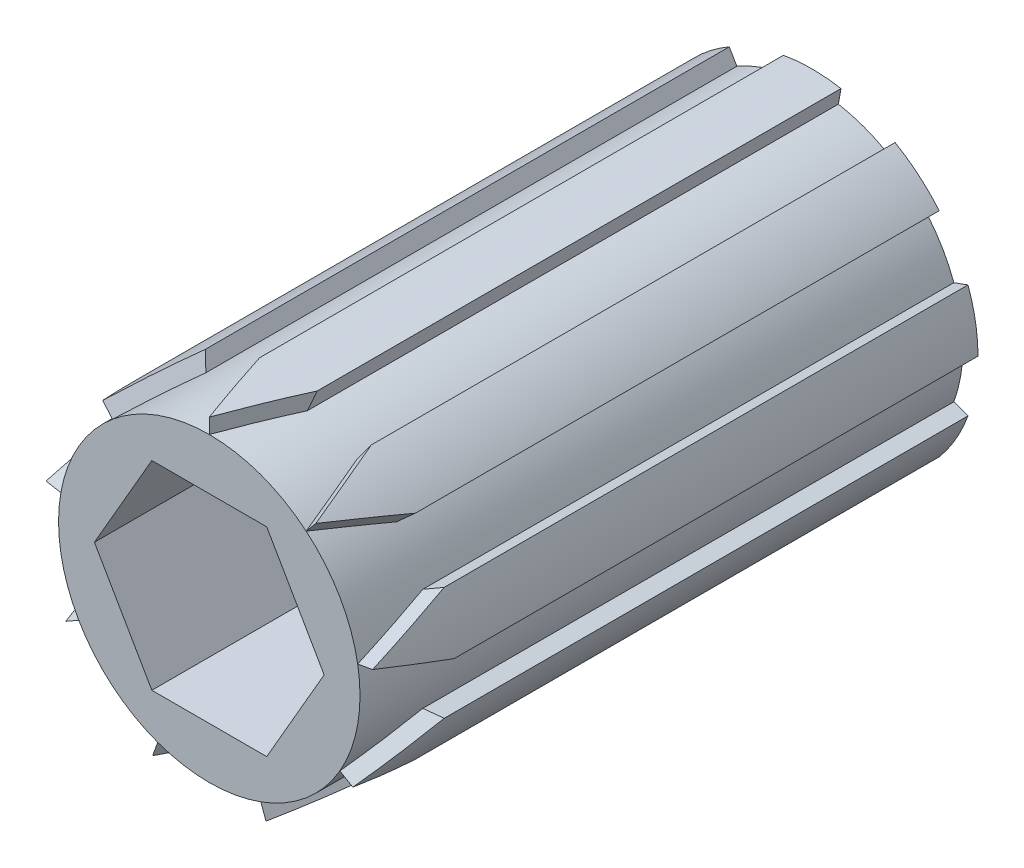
ISO-10303-21;
HEADER;
FILE_DESCRIPTION(('STEP AP214'),'2;1');
FILE_NAME('part.step','',(''),(''),'','','');
FILE_SCHEMA(('AUTOMOTIVE_DESIGN { 1 0 10303 214 1 1 1 1 }'));
ENDSEC;
DATA;
#1=APPLICATION_CONTEXT('core data for automotive mechanical design processes');
#2=APPLICATION_PROTOCOL_DEFINITION('international standard','automotive_design',2000,#1);
#3=PRODUCT_CONTEXT('',#1,'mechanical');
#4=PRODUCT('Part','Part','',(#3));
#5=PRODUCT_RELATED_PRODUCT_CATEGORY('part','',(#4));
#6=PRODUCT_DEFINITION_FORMATION('','',#4);
#7=PRODUCT_DEFINITION_CONTEXT('part definition',#1,'design');
#8=PRODUCT_DEFINITION('design','',#6,#7);
#9=PRODUCT_DEFINITION_SHAPE('','',#8);
#10=(LENGTH_UNIT() NAMED_UNIT(*) SI_UNIT(.MILLI.,.METRE.));
#11=(NAMED_UNIT(*) PLANE_ANGLE_UNIT() SI_UNIT($,.RADIAN.));
#12=(NAMED_UNIT(*) SI_UNIT($,.STERADIAN.) SOLID_ANGLE_UNIT());
#13=UNCERTAINTY_MEASURE_WITH_UNIT(LENGTH_MEASURE(1.E-05),#10,'distance_accuracy_value','');
#14=(GEOMETRIC_REPRESENTATION_CONTEXT(3) GLOBAL_UNCERTAINTY_ASSIGNED_CONTEXT((#13)) GLOBAL_UNIT_ASSIGNED_CONTEXT((#10,
#11,#12)) REPRESENTATION_CONTEXT('',''));
#15=CARTESIAN_POINT('',(0.,0.,0.));
#16=DIRECTION('',(0.,0.,1.));
#17=DIRECTION('',(1.,0.,0.));
#18=AXIS2_PLACEMENT_3D('',#15,#16,#17);
#19=CARTESIAN_POINT('',(0.,0.,20.));
#20=DIRECTION('',(0.,0.,-1.));
#21=DIRECTION('',(-1.,0.,0.));
#22=AXIS2_PLACEMENT_3D('',#19,#20,#21);
#23=CYLINDRICAL_SURFACE('',#22,5.);
#24=CARTESIAN_POINT('',(0.,0.,20.));
#25=DIRECTION('',(-0.719846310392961,-0.604022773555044,-0.342020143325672));
#26=DIRECTION('',(0.26200263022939,0.219846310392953,-0.939692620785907));
#27=AXIS2_PLACEMENT_3D('',#24,#25,#26);
#28=ELLIPSE('',#27,14.6190220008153,5.);
#29=CARTESIAN_POINT('',(-2.49999999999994,4.33012701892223,17.6145277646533));
#30=VERTEX_POINT('',#29);
#31=CARTESIAN_POINT('',(-3.21393804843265,3.83022221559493,20.));
#32=VERTEX_POINT('',#31);
#33=EDGE_CURVE('E484',#30,#32,#28,.F.);
#34=ORIENTED_EDGE('',*,*,#33,.T.);
#35=CARTESIAN_POINT('',(0.,0.,20.));
#36=DIRECTION('',(0.,0.,1.));
#37=DIRECTION('',(1.,0.,0.));
#38=AXIS2_PLACEMENT_3D('',#35,#36,#37);
#39=CIRCLE('',#38,5.);
#40=CARTESIAN_POINT('',(0.,5.,20.));
#41=VERTEX_POINT('',#40);
#42=EDGE_CURVE('E755',#41,#32,#39,.T.);
#43=ORIENTED_EDGE('',*,*,#42,.F.);
#44=CARTESIAN_POINT('',(0.,0.,20.));
#45=DIRECTION('',(0.939692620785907,0.,-0.342020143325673));
#46=DIRECTION('',(-0.342020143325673,0.,-0.939692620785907));
#47=AXIS2_PLACEMENT_3D('',#44,#45,#46);
#48=ELLIPSE('',#47,14.6190220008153,5.);
#49=CARTESIAN_POINT('',(-0.868240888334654,4.92403876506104,17.6145277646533));
#50=VERTEX_POINT('',#49);
#51=EDGE_CURVE('E522',#41,#50,#48,.F.);
#52=ORIENTED_EDGE('',*,*,#51,.T.);
#53=DIRECTION('',(0.,0.,-1.));
#54=VECTOR('',#53,1.);
#55=CARTESIAN_POINT('',(-0.868240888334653,4.92403876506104,21.9950758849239));
#56=LINE('',#55,#54);
#57=CARTESIAN_POINT('',(-0.868240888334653,4.92403876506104,0.));
#58=VERTEX_POINT('',#57);
#59=EDGE_CURVE('E683',#50,#58,#56,.T.);
#60=ORIENTED_EDGE('',*,*,#59,.T.);
#61=CARTESIAN_POINT('',(0.,0.,0.));
#62=DIRECTION('',(0.,0.,1.));
#63=DIRECTION('',(1.,0.,0.));
#64=AXIS2_PLACEMENT_3D('',#61,#62,#63);
#65=CIRCLE('',#64,5.);
#66=CARTESIAN_POINT('',(-2.49999999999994,4.33012701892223,0.));
#67=VERTEX_POINT('',#66);
#68=EDGE_CURVE('E759',#58,#67,#65,.T.);
#69=ORIENTED_EDGE('',*,*,#68,.T.);
#70=DIRECTION('',(0.,0.,-1.));
#71=VECTOR('',#70,1.);
#72=CARTESIAN_POINT('',(-2.49999999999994,4.33012701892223,22.3098121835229));
#73=LINE('',#72,#71);
#74=EDGE_CURVE('E539',#30,#67,#73,.T.);
#75=ORIENTED_EDGE('',*,*,#74,.F.);
#76=EDGE_LOOP('',(#34,#43,#52,#60,#69,#75));
#77=FACE_BOUND('',#76,.T.);
#78=ADVANCED_FACE('F35',(#77),#23,.T.);
#79=CARTESIAN_POINT('',(0.,0.,20.));
#80=DIRECTION('',(-0.163175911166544,-0.92541657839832,-0.342020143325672));
#81=DIRECTION('',(0.0593911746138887,0.336824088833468,-0.939692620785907));
#82=AXIS2_PLACEMENT_3D('',#79,#80,#81);
#83=ELLIPSE('',#82,14.6190220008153,5.);
#84=CARTESIAN_POINT('',(-4.69846310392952,1.7101007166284,17.6145277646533));
#85=VERTEX_POINT('',#84);
#86=CARTESIAN_POINT('',(-4.92403876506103,0.868240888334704,20.));
#87=VERTEX_POINT('',#86);
#88=EDGE_CURVE('E475',#85,#87,#83,.F.);
#89=ORIENTED_EDGE('',*,*,#88,.T.);
#90=EDGE_CURVE('E758',#32,#87,#39,.T.);
#91=ORIENTED_EDGE('',*,*,#90,.F.);
#92=CARTESIAN_POINT('',(0.,0.,20.));
#93=DIRECTION('',(0.71984631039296,0.604022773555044,-0.342020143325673));
#94=DIRECTION('',(-0.262002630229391,-0.219846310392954,-0.939692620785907));
#95=AXIS2_PLACEMENT_3D('',#92,#93,#94);
#96=ELLIPSE('',#95,14.6190220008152,5.);
#97=CARTESIAN_POINT('',(-3.83022221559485,3.21393804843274,17.6145277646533));
#98=VERTEX_POINT('',#97);
#99=EDGE_CURVE('E481',#32,#98,#96,.F.);
#100=ORIENTED_EDGE('',*,*,#99,.T.);
#101=DIRECTION('',(0.,0.,-1.));
#102=VECTOR('',#101,1.);
#103=CARTESIAN_POINT('',(-3.83022221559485,3.21393804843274,22.3098121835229));
#104=LINE('',#103,#102);
#105=CARTESIAN_POINT('',(-3.83022221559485,3.21393804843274,0.));
#106=VERTEX_POINT('',#105);
#107=EDGE_CURVE('E548',#98,#106,#104,.T.);
#108=ORIENTED_EDGE('',*,*,#107,.T.);
#109=CARTESIAN_POINT('',(-4.69846310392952,1.7101007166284,0.));
#110=VERTEX_POINT('',#109);
#111=EDGE_CURVE('E762',#106,#110,#65,.T.);
#112=ORIENTED_EDGE('',*,*,#111,.T.);
#113=DIRECTION('',(0.,0.,-1.));
#114=VECTOR('',#113,1.);
#115=CARTESIAN_POINT('',(-4.69846310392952,1.7101007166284,22.0447589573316));
#116=LINE('',#115,#114);
#117=EDGE_CURVE('E556',#85,#110,#116,.T.);
#118=ORIENTED_EDGE('',*,*,#117,.F.);
#119=EDGE_LOOP('',(#89,#91,#100,#108,#112,#118));
#120=FACE_BOUND('',#119,.T.);
#121=ADVANCED_FACE('F925',(#120),#23,.T.);
#122=CARTESIAN_POINT('',(0.,0.,20.));
#123=DIRECTION('',(0.469846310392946,-0.813797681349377,-0.342020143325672));
#124=DIRECTION('',(-0.171010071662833,0.296198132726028,-0.939692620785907));
#125=AXIS2_PLACEMENT_3D('',#122,#123,#124);
#126=ELLIPSE('',#125,14.6190220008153,5.);
#127=CARTESIAN_POINT('',(-4.69846310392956,-1.7101007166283,17.6145277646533));
#128=VERTEX_POINT('',#127);
#129=CARTESIAN_POINT('',(-4.33012701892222,-2.49999999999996,20.));
#130=VERTEX_POINT('',#129);
#131=EDGE_CURVE('E466',#128,#130,#126,.F.);
#132=ORIENTED_EDGE('',*,*,#131,.T.);
#133=EDGE_CURVE('E1761',#87,#130,#39,.T.);
#134=ORIENTED_EDGE('',*,*,#133,.F.);
#135=CARTESIAN_POINT('',(0.,0.,20.));
#136=DIRECTION('',(0.163175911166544,0.92541657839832,-0.342020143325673));
#137=DIRECTION('',(-0.0593911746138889,-0.336824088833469,-0.939692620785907));
#138=AXIS2_PLACEMENT_3D('',#135,#136,#137);
#139=ELLIPSE('',#138,14.6190220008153,5.);
#140=CARTESIAN_POINT('',(-5.,0.,17.6145277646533));
#141=VERTEX_POINT('',#140);
#142=EDGE_CURVE('E472',#87,#141,#139,.F.);
#143=ORIENTED_EDGE('',*,*,#142,.T.);
#144=DIRECTION('',(0.,0.,-1.));
#145=VECTOR('',#144,1.);
#146=CARTESIAN_POINT('',(-5.,0.,22.0447589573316));
#147=LINE('',#146,#145);
#148=CARTESIAN_POINT('',(-5.,0.,0.));
#149=VERTEX_POINT('',#148);
#150=EDGE_CURVE('E565',#141,#149,#147,.T.);
#151=ORIENTED_EDGE('',*,*,#150,.T.);
#152=CARTESIAN_POINT('',(-4.69846310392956,-1.7101007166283,0.));
#153=VERTEX_POINT('',#152);
#154=EDGE_CURVE('E928',#149,#153,#65,.T.);
#155=ORIENTED_EDGE('',*,*,#154,.T.);
#156=DIRECTION('',(0.,0.,-1.));
#157=VECTOR('',#156,1.);
#158=CARTESIAN_POINT('',(-4.69846310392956,-1.7101007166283,22.2631716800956));
#159=LINE('',#158,#157);
#160=EDGE_CURVE('E573',#128,#153,#159,.T.);
#161=ORIENTED_EDGE('',*,*,#160,.F.);
#162=EDGE_LOOP('',(#132,#134,#143,#151,#155,#161));
#163=FACE_BOUND('',#162,.T.);
#164=ADVANCED_FACE('F988',(#163),#23,.T.);
#165=CARTESIAN_POINT('',(0.,0.,20.));
#166=DIRECTION('',(0.883022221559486,-0.321393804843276,-0.342020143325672));
#167=DIRECTION('',(-0.321393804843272,0.116977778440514,-0.939692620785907));
#168=AXIS2_PLACEMENT_3D('',#165,#166,#167);
#169=ELLIPSE('',#168,14.6190220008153,5.);
#170=CARTESIAN_POINT('',(-2.50000000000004,-4.33012701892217,17.6145277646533));
#171=VERTEX_POINT('',#170);
#172=CARTESIAN_POINT('',(-1.71010071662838,-4.69846310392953,20.));
#173=VERTEX_POINT('',#172);
#174=EDGE_CURVE('E457',#171,#173,#169,.F.);
#175=ORIENTED_EDGE('',*,*,#174,.T.);
#176=EDGE_CURVE('E1015',#130,#173,#39,.T.);
#177=ORIENTED_EDGE('',*,*,#176,.F.);
#178=CARTESIAN_POINT('',(0.,0.,20.));
#179=DIRECTION('',(-0.469846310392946,0.813797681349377,-0.342020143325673));
#180=DIRECTION('',(0.171010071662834,-0.296198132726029,-0.939692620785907));
#181=AXIS2_PLACEMENT_3D('',#178,#179,#180);
#182=ELLIPSE('',#181,14.6190220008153,5.);
#183=CARTESIAN_POINT('',(-3.83022221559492,-3.21393804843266,17.6145277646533));
#184=VERTEX_POINT('',#183);
#185=EDGE_CURVE('E463',#130,#184,#182,.F.);
#186=ORIENTED_EDGE('',*,*,#185,.T.);
#187=DIRECTION('',(0.,0.,-1.));
#188=VECTOR('',#187,1.);
#189=CARTESIAN_POINT('',(-3.83022221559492,-3.21393804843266,22.2631716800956));
#190=LINE('',#189,#188);
#191=CARTESIAN_POINT('',(-3.83022221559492,-3.21393804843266,0.));
#192=VERTEX_POINT('',#191);
#193=EDGE_CURVE('E582',#184,#192,#190,.T.);
#194=ORIENTED_EDGE('',*,*,#193,.T.);
#195=CARTESIAN_POINT('',(-2.50000000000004,-4.33012701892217,0.));
#196=VERTEX_POINT('',#195);
#197=EDGE_CURVE('E930',#192,#196,#65,.T.);
#198=ORIENTED_EDGE('',*,*,#197,.T.);
#199=DIRECTION('',(0.,0.,-1.));
#200=VECTOR('',#199,1.);
#201=CARTESIAN_POINT('',(-2.50000000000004,-4.33012701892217,22.1728090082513));
#202=LINE('',#201,#200);
#203=EDGE_CURVE('E590',#171,#196,#202,.T.);
#204=ORIENTED_EDGE('',*,*,#203,.F.);
#205=EDGE_LOOP('',(#175,#177,#186,#194,#198,#204));
#206=FACE_BOUND('',#205,.T.);
#207=ADVANCED_FACE('F1006',(#206),#23,.T.);
#208=CARTESIAN_POINT('',(0.,0.,20.));
#209=DIRECTION('',(0.88302222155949,0.321393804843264,-0.342020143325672));
#210=DIRECTION('',(-0.321393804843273,-0.11697777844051,-0.939692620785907));
#211=AXIS2_PLACEMENT_3D('',#208,#209,#210);
#212=ELLIPSE('',#211,14.6190220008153,5.);
#213=CARTESIAN_POINT('',(0.868240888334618,-4.92403876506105,17.6145277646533));
#214=VERTEX_POINT('',#213);
#215=CARTESIAN_POINT('',(1.71010071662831,-4.69846310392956,20.));
#216=VERTEX_POINT('',#215);
#217=EDGE_CURVE('E448',#214,#216,#212,.F.);
#218=ORIENTED_EDGE('',*,*,#217,.T.);
#219=EDGE_CURVE('E1762',#173,#216,#39,.T.);
#220=ORIENTED_EDGE('',*,*,#219,.F.);
#221=CARTESIAN_POINT('',(0.,0.,20.));
#222=DIRECTION('',(-0.883022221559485,0.321393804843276,-0.342020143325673));
#223=DIRECTION('',(0.321393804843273,-0.116977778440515,-0.939692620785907));
#224=AXIS2_PLACEMENT_3D('',#221,#222,#223);
#225=ELLIPSE('',#224,14.6190220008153,5.);
#226=CARTESIAN_POINT('',(-0.868240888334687,-4.92403876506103,17.6145277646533));
#227=VERTEX_POINT('',#226);
#228=EDGE_CURVE('E454',#173,#227,#225,.F.);
#229=ORIENTED_EDGE('',*,*,#228,.T.);
#230=DIRECTION('',(0.,0.,-1.));
#231=VECTOR('',#230,1.);
#232=CARTESIAN_POINT('',(-0.868240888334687,-4.92403876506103,22.1728090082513));
#233=LINE('',#232,#231);
#234=CARTESIAN_POINT('',(-0.868240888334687,-4.92403876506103,0.));
#235=VERTEX_POINT('',#234);
#236=EDGE_CURVE('E599',#227,#235,#233,.T.);
#237=ORIENTED_EDGE('',*,*,#236,.T.);
#238=CARTESIAN_POINT('',(0.868240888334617,-4.92403876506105,0.));
#239=VERTEX_POINT('',#238);
#240=EDGE_CURVE('E864',#235,#239,#65,.T.);
#241=ORIENTED_EDGE('',*,*,#240,.T.);
#242=DIRECTION('',(0.,0.,-1.));
#243=VECTOR('',#242,1.);
#244=CARTESIAN_POINT('',(0.868240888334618,-4.92403876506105,22.1728090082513));
#245=LINE('',#244,#243);
#246=EDGE_CURVE('E607',#214,#239,#245,.T.);
#247=ORIENTED_EDGE('',*,*,#246,.F.);
#248=EDGE_LOOP('',(#218,#220,#229,#237,#241,#247));
#249=FACE_BOUND('',#248,.T.);
#250=ADVANCED_FACE('F942',(#249),#23,.T.);
#251=CARTESIAN_POINT('',(0.,0.,20.));
#252=DIRECTION('',(0.469846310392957,0.813797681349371,-0.342020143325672));
#253=DIRECTION('',(-0.171010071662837,-0.296198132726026,-0.939692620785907));
#254=AXIS2_PLACEMENT_3D('',#251,#252,#253);
#255=ELLIPSE('',#254,14.6190220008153,5.);
#256=CARTESIAN_POINT('',(3.83022221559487,-3.21393804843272,17.6145277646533));
#257=VERTEX_POINT('',#256);
#258=CARTESIAN_POINT('',(4.33012701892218,-2.50000000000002,20.));
#259=VERTEX_POINT('',#258);
#260=EDGE_CURVE('E440',#257,#259,#255,.F.);
#261=ORIENTED_EDGE('',*,*,#260,.T.);
#262=EDGE_CURVE('E399',#216,#259,#39,.T.);
#263=ORIENTED_EDGE('',*,*,#262,.F.);
#264=CARTESIAN_POINT('',(0.,0.,20.));
#265=DIRECTION('',(-0.883022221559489,-0.321393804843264,-0.342020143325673));
#266=DIRECTION('',(0.321393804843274,0.116977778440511,-0.939692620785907));
#267=AXIS2_PLACEMENT_3D('',#264,#265,#266);
#268=ELLIPSE('',#267,14.6190220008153,5.);
#269=CARTESIAN_POINT('',(2.49999999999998,-4.33012701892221,17.6145277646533));
#270=VERTEX_POINT('',#269);
#271=EDGE_CURVE('E445',#216,#270,#268,.F.);
#272=ORIENTED_EDGE('',*,*,#271,.T.);
#273=DIRECTION('',(0.,0.,-1.));
#274=VECTOR('',#273,1.);
#275=CARTESIAN_POINT('',(2.49999999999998,-4.33012701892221,22.1728090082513));
#276=LINE('',#275,#274);
#277=CARTESIAN_POINT('',(2.49999999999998,-4.33012701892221,0.));
#278=VERTEX_POINT('',#277);
#279=EDGE_CURVE('E616',#270,#278,#276,.T.);
#280=ORIENTED_EDGE('',*,*,#279,.T.);
#281=CARTESIAN_POINT('',(3.83022221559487,-3.21393804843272,0.));
#282=VERTEX_POINT('',#281);
#283=EDGE_CURVE('E861',#278,#282,#65,.T.);
#284=ORIENTED_EDGE('',*,*,#283,.T.);
#285=DIRECTION('',(0.,0.,-1.));
#286=VECTOR('',#285,1.);
#287=CARTESIAN_POINT('',(3.83022221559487,-3.21393804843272,22.2631716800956));
#288=LINE('',#287,#286);
#289=EDGE_CURVE('E624',#257,#282,#288,.T.);
#290=ORIENTED_EDGE('',*,*,#289,.F.);
#291=EDGE_LOOP('',(#261,#263,#272,#280,#284,#290));
#292=FACE_BOUND('',#291,.T.);
#293=ADVANCED_FACE('F969',(#292),#23,.T.);
#294=CARTESIAN_POINT('',(0.,0.,20.));
#295=DIRECTION('',(-0.163175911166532,0.925416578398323,-0.342020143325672));
#296=DIRECTION('',(0.0593911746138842,-0.336824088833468,-0.939692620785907));
#297=AXIS2_PLACEMENT_3D('',#294,#295,#296);
#298=ELLIPSE('',#297,14.6190220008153,5.);
#299=CARTESIAN_POINT('',(5.,0.,17.6145277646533));
#300=VERTEX_POINT('',#299);
#301=CARTESIAN_POINT('',(4.92403876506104,0.868240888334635,20.));
#302=VERTEX_POINT('',#301);
#303=EDGE_CURVE('E417',#300,#302,#298,.F.);
#304=ORIENTED_EDGE('',*,*,#303,.T.);
#305=EDGE_CURVE('E392',#259,#302,#39,.T.);
#306=ORIENTED_EDGE('',*,*,#305,.F.);
#307=CARTESIAN_POINT('',(0.,0.,20.));
#308=DIRECTION('',(-0.469846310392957,-0.81379768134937,-0.342020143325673));
#309=DIRECTION('',(0.171010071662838,0.296198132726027,-0.939692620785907));
#310=AXIS2_PLACEMENT_3D('',#307,#308,#309);
#311=ELLIPSE('',#310,14.6190220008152,5.);
#312=CARTESIAN_POINT('',(4.69846310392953,-1.71010071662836,17.6145277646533));
#313=VERTEX_POINT('',#312);
#314=EDGE_CURVE('E438',#259,#313,#311,.F.);
#315=ORIENTED_EDGE('',*,*,#314,.T.);
#316=DIRECTION('',(0.,0.,-1.));
#317=VECTOR('',#316,1.);
#318=CARTESIAN_POINT('',(4.69846310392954,-1.71010071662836,22.2631716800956));
#319=LINE('',#318,#317);
#320=CARTESIAN_POINT('',(4.69846310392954,-1.71010071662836,0.));
#321=VERTEX_POINT('',#320);
#322=EDGE_CURVE('E633',#313,#321,#319,.T.);
#323=ORIENTED_EDGE('',*,*,#322,.T.);
#324=CARTESIAN_POINT('',(5.,0.,0.));
#325=VERTEX_POINT('',#324);
#326=EDGE_CURVE('E859',#321,#325,#65,.T.);
#327=ORIENTED_EDGE('',*,*,#326,.T.);
#328=DIRECTION('',(0.,0.,-1.));
#329=VECTOR('',#328,1.);
#330=CARTESIAN_POINT('',(5.,0.,22.0447589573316));
#331=LINE('',#330,#329);
#332=EDGE_CURVE('E420',#300,#325,#331,.T.);
#333=ORIENTED_EDGE('',*,*,#332,.F.);
#334=EDGE_LOOP('',(#304,#306,#315,#323,#327,#333));
#335=FACE_BOUND('',#334,.T.);
#336=ADVANCED_FACE('F418',(#335),#23,.T.);
#337=CARTESIAN_POINT('',(0.,0.,20.));
#338=DIRECTION('',(0.163175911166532,-0.925416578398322,-0.342020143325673));
#339=DIRECTION('',(-0.0593911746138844,0.33682408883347,-0.939692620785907));
#340=AXIS2_PLACEMENT_3D('',#337,#338,#339);
#341=ELLIPSE('',#340,14.6190220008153,5.);
#342=CARTESIAN_POINT('',(4.69846310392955,1.71010071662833,17.6145277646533));
#343=VERTEX_POINT('',#342);
#344=EDGE_CURVE('E410',#302,#343,#341,.F.);
#345=ORIENTED_EDGE('',*,*,#344,.T.);
#346=DIRECTION('',(0.,0.,-1.));
#347=VECTOR('',#346,1.);
#348=CARTESIAN_POINT('',(4.69846310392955,1.71010071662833,22.0447589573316));
#349=LINE('',#348,#347);
#350=CARTESIAN_POINT('',(4.69846310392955,1.71010071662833,0.));
#351=VERTEX_POINT('',#350);
#352=EDGE_CURVE('E649',#343,#351,#349,.T.);
#353=ORIENTED_EDGE('',*,*,#352,.T.);
#354=CARTESIAN_POINT('',(3.8302222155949,3.21393804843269,0.));
#355=VERTEX_POINT('',#354);
#356=EDGE_CURVE('E862',#351,#355,#65,.T.);
#357=ORIENTED_EDGE('',*,*,#356,.T.);
#358=DIRECTION('',(0.,0.,-1.));
#359=VECTOR('',#358,1.);
#360=CARTESIAN_POINT('',(3.8302222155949,3.21393804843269,22.3098121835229));
#361=LINE('',#360,#359);
#362=CARTESIAN_POINT('',(3.8302222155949,3.21393804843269,17.6145277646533));
#363=VERTEX_POINT('',#362);
#364=EDGE_CURVE('E657',#363,#355,#361,.T.);
#365=ORIENTED_EDGE('',*,*,#364,.F.);
#366=CARTESIAN_POINT('',(0.,0.,20.));
#367=DIRECTION('',(-0.719846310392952,0.604022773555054,-0.342020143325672));
#368=DIRECTION('',(0.262002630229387,-0.219846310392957,-0.939692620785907));
#369=AXIS2_PLACEMENT_3D('',#366,#367,#368);
#370=ELLIPSE('',#369,14.6190220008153,5.);
#371=CARTESIAN_POINT('',(3.2139380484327,3.83022221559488,20.));
#372=VERTEX_POINT('',#371);
#373=EDGE_CURVE('E413',#363,#372,#370,.F.);
#374=ORIENTED_EDGE('',*,*,#373,.T.);
#375=EDGE_CURVE('E396',#302,#372,#39,.T.);
#376=ORIENTED_EDGE('',*,*,#375,.F.);
#377=EDGE_LOOP('',(#345,#353,#357,#365,#374,#376));
#378=FACE_BOUND('',#377,.T.);
#379=ADVANCED_FACE('F408',(#378),#23,.T.);
#380=CARTESIAN_POINT('',(0.,0.,20.));
#381=DIRECTION('',(0.719846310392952,-0.604022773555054,-0.342020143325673));
#382=DIRECTION('',(-0.262002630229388,0.219846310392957,-0.939692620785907));
#383=AXIS2_PLACEMENT_3D('',#380,#381,#382);
#384=ELLIPSE('',#383,14.6190220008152,5.);
#385=CARTESIAN_POINT('',(2.5,4.33012701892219,17.6145277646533));
#386=VERTEX_POINT('',#385);
#387=EDGE_CURVE('E511',#372,#386,#384,.F.);
#388=ORIENTED_EDGE('',*,*,#387,.T.);
#389=DIRECTION('',(0.,0.,-1.));
#390=VECTOR('',#389,1.);
#391=CARTESIAN_POINT('',(2.50000000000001,4.33012701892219,22.3098121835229));
#392=LINE('',#391,#390);
#393=CARTESIAN_POINT('',(2.50000000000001,4.33012701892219,0.));
#394=VERTEX_POINT('',#393);
#395=EDGE_CURVE('E666',#386,#394,#392,.T.);
#396=ORIENTED_EDGE('',*,*,#395,.T.);
#397=CARTESIAN_POINT('',(0.868240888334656,4.92403876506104,0.));
#398=VERTEX_POINT('',#397);
#399=EDGE_CURVE('E741',#394,#398,#65,.T.);
#400=ORIENTED_EDGE('',*,*,#399,.T.);
#401=DIRECTION('',(0.,0.,-1.));
#402=VECTOR('',#401,1.);
#403=CARTESIAN_POINT('',(0.868240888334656,4.92403876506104,21.9950758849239));
#404=LINE('',#403,#402);
#405=CARTESIAN_POINT('',(0.868240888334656,4.92403876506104,17.6145277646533));
#406=VERTEX_POINT('',#405);
#407=EDGE_CURVE('E674',#406,#398,#404,.T.);
#408=ORIENTED_EDGE('',*,*,#407,.F.);
#409=CARTESIAN_POINT('',(0.,0.,20.));
#410=DIRECTION('',(-0.939692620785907,0.,-0.342020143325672));
#411=DIRECTION('',(0.342020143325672,0.,-0.939692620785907));
#412=AXIS2_PLACEMENT_3D('',#409,#410,#411);
#413=ELLIPSE('',#412,14.6190220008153,5.);
#414=EDGE_CURVE('E525',#406,#41,#413,.F.);
#415=ORIENTED_EDGE('',*,*,#414,.T.);
#416=EDGE_CURVE('E415',#372,#41,#39,.T.);
#417=ORIENTED_EDGE('',*,*,#416,.F.);
#418=EDGE_LOOP('',(#388,#396,#400,#408,#415,#417));
#419=FACE_BOUND('',#418,.T.);
#420=ADVANCED_FACE('F871',(#419),#23,.T.);
#421=CARTESIAN_POINT('',(0.,0.,20.));
#422=DIRECTION('',(0.,0.,1.));
#423=DIRECTION('',(1.,0.,0.));
#424=AXIS2_PLACEMENT_3D('',#421,#422,#423);
#425=PLANE('',#424);
#426=ORIENTED_EDGE('',*,*,#305,.T.);
#427=ORIENTED_EDGE('',*,*,#375,.T.);
#428=ORIENTED_EDGE('',*,*,#416,.T.);
#429=ORIENTED_EDGE('',*,*,#42,.T.);
#430=ORIENTED_EDGE('',*,*,#90,.T.);
#431=ORIENTED_EDGE('',*,*,#133,.T.);
#432=ORIENTED_EDGE('',*,*,#176,.T.);
#433=ORIENTED_EDGE('',*,*,#219,.T.);
#434=ORIENTED_EDGE('',*,*,#262,.T.);
#435=EDGE_LOOP('',(#426,#427,#428,#429,#430,#431,#432,#433,#434));
#436=FACE_BOUND('',#435,.T.);
#437=DIRECTION('',(0.5,0.866025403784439,0.));
#438=VECTOR('',#437,1.);
#439=CARTESIAN_POINT('',(1.90525588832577,-3.3,20.));
#440=LINE('',#439,#438);
#441=CARTESIAN_POINT('',(1.90525588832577,-3.3,20.));
#442=VERTEX_POINT('',#441);
#443=CARTESIAN_POINT('',(3.81051177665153,0.,20.));
#444=VERTEX_POINT('',#443);
#445=EDGE_CURVE('E688',#442,#444,#440,.T.);
#446=ORIENTED_EDGE('',*,*,#445,.F.);
#447=DIRECTION('',(1.,0.,0.));
#448=VECTOR('',#447,1.);
#449=CARTESIAN_POINT('',(-1.90525588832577,-3.3,20.));
#450=LINE('',#449,#448);
#451=CARTESIAN_POINT('',(-1.90525588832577,-3.3,20.));
#452=VERTEX_POINT('',#451);
#453=EDGE_CURVE('E703',#452,#442,#450,.T.);
#454=ORIENTED_EDGE('',*,*,#453,.F.);
#455=DIRECTION('',(0.5,-0.866025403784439,0.));
#456=VECTOR('',#455,1.);
#457=CARTESIAN_POINT('',(-3.81051177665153,0.,20.));
#458=LINE('',#457,#456);
#459=CARTESIAN_POINT('',(-3.81051177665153,0.,20.));
#460=VERTEX_POINT('',#459);
#461=EDGE_CURVE('E700',#460,#452,#458,.T.);
#462=ORIENTED_EDGE('',*,*,#461,.F.);
#463=DIRECTION('',(-0.5,-0.866025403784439,0.));
#464=VECTOR('',#463,1.);
#465=CARTESIAN_POINT('',(-1.90525588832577,3.3,20.));
#466=LINE('',#465,#464);
#467=CARTESIAN_POINT('',(-1.90525588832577,3.3,20.));
#468=VERTEX_POINT('',#467);
#469=EDGE_CURVE('E697',#468,#460,#466,.T.);
#470=ORIENTED_EDGE('',*,*,#469,.F.);
#471=DIRECTION('',(-1.,0.,0.));
#472=VECTOR('',#471,1.);
#473=CARTESIAN_POINT('',(1.90525588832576,3.3,20.));
#474=LINE('',#473,#472);
#475=CARTESIAN_POINT('',(1.90525588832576,3.3,20.));
#476=VERTEX_POINT('',#475);
#477=EDGE_CURVE('E694',#476,#468,#474,.T.);
#478=ORIENTED_EDGE('',*,*,#477,.F.);
#479=DIRECTION('',(-0.5,0.866025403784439,0.));
#480=VECTOR('',#479,1.);
#481=CARTESIAN_POINT('',(3.81051177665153,0.,20.));
#482=LINE('',#481,#480);
#483=EDGE_CURVE('E690',#444,#476,#482,.T.);
#484=ORIENTED_EDGE('',*,*,#483,.F.);
#485=EDGE_LOOP('',(#446,#454,#462,#470,#478,#484));
#486=FACE_BOUND('',#485,.T.);
#487=ADVANCED_FACE('F394',(#436,#486),#425,.T.);
#488=CARTESIAN_POINT('',(0.,0.,0.));
#489=DIRECTION('',(0.,0.,1.));
#490=DIRECTION('',(1.,0.,0.));
#491=AXIS2_PLACEMENT_3D('',#488,#489,#490);
#492=PLANE('',#491);
#493=ORIENTED_EDGE('',*,*,#68,.F.);
#494=DIRECTION('',(-0.173648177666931,0.984807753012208,0.));
#495=VECTOR('',#494,1.);
#496=CARTESIAN_POINT('',(-0.868240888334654,4.92403876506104,0.));
#497=LINE('',#496,#495);
#498=CARTESIAN_POINT('',(-0.955064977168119,5.41644264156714,0.));
#499=VERTEX_POINT('',#498);
#500=EDGE_CURVE('E671',#58,#499,#497,.T.);
#501=ORIENTED_EDGE('',*,*,#500,.T.);
#502=CARTESIAN_POINT('',(0.,0.,0.));
#503=DIRECTION('',(0.,0.,-1.));
#504=DIRECTION('',(-1.,0.,0.));
#505=AXIS2_PLACEMENT_3D('',#502,#503,#504);
#506=CIRCLE('',#505,5.5);
#507=CARTESIAN_POINT('',(0.955064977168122,5.41644264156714,0.));
#508=VERTEX_POINT('',#507);
#509=EDGE_CURVE('E670',#499,#508,#506,.T.);
#510=ORIENTED_EDGE('',*,*,#509,.T.);
#511=DIRECTION('',(-0.173648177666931,-0.984807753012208,0.));
#512=VECTOR('',#511,1.);
#513=CARTESIAN_POINT('',(0.868240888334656,4.92403876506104,0.));
#514=LINE('',#513,#512);
#515=EDGE_CURVE('E675',#508,#398,#514,.T.);
#516=ORIENTED_EDGE('',*,*,#515,.T.);
#517=ORIENTED_EDGE('',*,*,#399,.F.);
#518=DIRECTION('',(0.500000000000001,0.866025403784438,0.));
#519=VECTOR('',#518,1.);
#520=CARTESIAN_POINT('',(2.50000000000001,4.33012701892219,0.));
#521=LINE('',#520,#519);
#522=CARTESIAN_POINT('',(2.75000000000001,4.76313972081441,0.));
#523=VERTEX_POINT('',#522);
#524=EDGE_CURVE('E654',#394,#523,#521,.T.);
#525=ORIENTED_EDGE('',*,*,#524,.T.);
#526=CARTESIAN_POINT('',(0.,0.,0.));
#527=DIRECTION('',(0.,0.,-1.));
#528=DIRECTION('',(-0.766044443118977,0.642787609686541,0.));
#529=AXIS2_PLACEMENT_3D('',#526,#527,#528);
#530=CIRCLE('',#529,5.5);
#531=CARTESIAN_POINT('',(4.21324443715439,3.53533185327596,0.));
#532=VERTEX_POINT('',#531);
#533=EDGE_CURVE('E653',#523,#532,#530,.T.);
#534=ORIENTED_EDGE('',*,*,#533,.T.);
#535=DIRECTION('',(-0.76604444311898,-0.642787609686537,0.));
#536=VECTOR('',#535,1.);
#537=CARTESIAN_POINT('',(3.8302222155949,3.21393804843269,0.));
#538=LINE('',#537,#536);
#539=EDGE_CURVE('E658',#532,#355,#538,.T.);
#540=ORIENTED_EDGE('',*,*,#539,.T.);
#541=ORIENTED_EDGE('',*,*,#356,.F.);
#542=DIRECTION('',(0.939692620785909,0.342020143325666,0.));
#543=VECTOR('',#542,1.);
#544=CARTESIAN_POINT('',(4.69846310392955,1.71010071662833,0.));
#545=LINE('',#544,#543);
#546=CARTESIAN_POINT('',(5.1683094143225,1.88111078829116,0.));
#547=VERTEX_POINT('',#546);
#548=EDGE_CURVE('E638',#351,#547,#545,.T.);
#549=ORIENTED_EDGE('',*,*,#548,.T.);
#550=CARTESIAN_POINT('',(0.,0.,0.));
#551=DIRECTION('',(0.,0.,-1.));
#552=DIRECTION('',(-0.173648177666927,0.984807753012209,0.));
#553=AXIS2_PLACEMENT_3D('',#550,#551,#552);
#554=CIRCLE('',#553,5.5);
#555=CARTESIAN_POINT('',(5.5,0.,0.));
#556=VERTEX_POINT('',#555);
#557=EDGE_CURVE('E637',#547,#556,#554,.T.);
#558=ORIENTED_EDGE('',*,*,#557,.T.);
#559=DIRECTION('',(-1.,0.,0.));
#560=VECTOR('',#559,1.);
#561=CARTESIAN_POINT('',(5.,0.,0.));
#562=LINE('',#561,#560);
#563=EDGE_CURVE('E641',#556,#325,#562,.T.);
#564=ORIENTED_EDGE('',*,*,#563,.T.);
#565=ORIENTED_EDGE('',*,*,#326,.F.);
#566=DIRECTION('',(0.939692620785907,-0.342020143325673,0.));
#567=VECTOR('',#566,1.);
#568=CARTESIAN_POINT('',(4.69846310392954,-1.71010071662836,0.));
#569=LINE('',#568,#567);
#570=CARTESIAN_POINT('',(5.16830941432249,-1.8811107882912,0.));
#571=VERTEX_POINT('',#570);
#572=EDGE_CURVE('E621',#321,#571,#569,.T.);
#573=ORIENTED_EDGE('',*,*,#572,.T.);
#574=CARTESIAN_POINT('',(0.,0.,0.));
#575=DIRECTION('',(0.,0.,-1.));
#576=DIRECTION('',(0.500000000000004,0.866025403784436,0.));
#577=AXIS2_PLACEMENT_3D('',#574,#575,#576);
#578=CIRCLE('',#577,5.5);
#579=CARTESIAN_POINT('',(4.21324443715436,-3.53533185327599,0.));
#580=VERTEX_POINT('',#579);
#581=EDGE_CURVE('E620',#571,#580,#578,.T.);
#582=ORIENTED_EDGE('',*,*,#581,.T.);
#583=DIRECTION('',(-0.766044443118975,0.642787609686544,0.));
#584=VECTOR('',#583,1.);
#585=CARTESIAN_POINT('',(3.83022221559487,-3.21393804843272,0.));
#586=LINE('',#585,#584);
#587=EDGE_CURVE('E625',#580,#282,#586,.T.);
#588=ORIENTED_EDGE('',*,*,#587,.T.);
#589=ORIENTED_EDGE('',*,*,#283,.F.);
#590=DIRECTION('',(0.499999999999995,-0.866025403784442,0.));
#591=VECTOR('',#590,1.);
#592=CARTESIAN_POINT('',(2.49999999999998,-4.33012701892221,0.));
#593=LINE('',#592,#591);
#594=CARTESIAN_POINT('',(2.74999999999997,-4.76313972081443,0.));
#595=VERTEX_POINT('',#594);
#596=EDGE_CURVE('E604',#278,#595,#593,.T.);
#597=ORIENTED_EDGE('',*,*,#596,.T.);
#598=CARTESIAN_POINT('',(0.,0.,0.));
#599=DIRECTION('',(0.,0.,-1.));
#600=DIRECTION('',(0.939692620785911,0.342020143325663,0.));
#601=AXIS2_PLACEMENT_3D('',#598,#599,#600);
#602=CIRCLE('',#601,5.5);
#603=CARTESIAN_POINT('',(0.955064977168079,-5.41644264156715,0.));
#604=VERTEX_POINT('',#603);
#605=EDGE_CURVE('E603',#595,#604,#602,.T.);
#606=ORIENTED_EDGE('',*,*,#605,.T.);
#607=DIRECTION('',(-0.173648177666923,0.98480775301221,0.));
#608=VECTOR('',#607,1.);
#609=CARTESIAN_POINT('',(0.868240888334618,-4.92403876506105,0.));
#610=LINE('',#609,#608);
#611=EDGE_CURVE('E608',#604,#239,#610,.T.);
#612=ORIENTED_EDGE('',*,*,#611,.T.);
#613=ORIENTED_EDGE('',*,*,#240,.F.);
#614=DIRECTION('',(-0.173648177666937,-0.984807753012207,0.));
#615=VECTOR('',#614,1.);
#616=CARTESIAN_POINT('',(-0.868240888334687,-4.92403876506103,0.));
#617=LINE('',#616,#615);
#618=CARTESIAN_POINT('',(-0.955064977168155,-5.41644264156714,0.));
#619=VERTEX_POINT('',#618);
#620=EDGE_CURVE('E587',#235,#619,#617,.T.);
#621=ORIENTED_EDGE('',*,*,#620,.T.);
#622=CARTESIAN_POINT('',(0.,0.,0.));
#623=DIRECTION('',(0.,0.,-1.));
#624=DIRECTION('',(0.939692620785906,-0.342020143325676,0.));
#625=AXIS2_PLACEMENT_3D('',#622,#623,#624);
#626=CIRCLE('',#625,5.5);
#627=CARTESIAN_POINT('',(-2.75000000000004,-4.76313972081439,0.));
#628=VERTEX_POINT('',#627);
#629=EDGE_CURVE('E586',#619,#628,#626,.T.);
#630=ORIENTED_EDGE('',*,*,#629,.T.);
#631=DIRECTION('',(0.500000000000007,0.866025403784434,0.));
#632=VECTOR('',#631,1.);
#633=CARTESIAN_POINT('',(-2.50000000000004,-4.33012701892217,0.));
#634=LINE('',#633,#632);
#635=EDGE_CURVE('E591',#628,#196,#634,.T.);
#636=ORIENTED_EDGE('',*,*,#635,.T.);
#637=ORIENTED_EDGE('',*,*,#197,.F.);
#638=DIRECTION('',(-0.766044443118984,-0.642787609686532,0.));
#639=VECTOR('',#638,1.);
#640=CARTESIAN_POINT('',(-3.83022221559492,-3.21393804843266,0.));
#641=LINE('',#640,#639);
#642=CARTESIAN_POINT('',(-4.21324443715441,-3.53533185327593,0.));
#643=VERTEX_POINT('',#642);
#644=EDGE_CURVE('E570',#192,#643,#641,.T.);
#645=ORIENTED_EDGE('',*,*,#644,.T.);
#646=CARTESIAN_POINT('',(0.,0.,0.));
#647=DIRECTION('',(0.,0.,-1.));
#648=DIRECTION('',(0.499999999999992,-0.866025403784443,0.));
#649=AXIS2_PLACEMENT_3D('',#646,#647,#648);
#650=CIRCLE('',#649,5.5);
#651=CARTESIAN_POINT('',(-5.16830941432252,-1.88111078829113,0.));
#652=VERTEX_POINT('',#651);
#653=EDGE_CURVE('E569',#643,#652,#650,.T.);
#654=ORIENTED_EDGE('',*,*,#653,.T.);
#655=DIRECTION('',(0.939692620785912,0.342020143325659,0.));
#656=VECTOR('',#655,1.);
#657=CARTESIAN_POINT('',(-4.69846310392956,-1.7101007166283,0.));
#658=LINE('',#657,#656);
#659=EDGE_CURVE('E574',#652,#153,#658,.T.);
#660=ORIENTED_EDGE('',*,*,#659,.T.);
#661=ORIENTED_EDGE('',*,*,#154,.F.);
#662=DIRECTION('',(-1.,0.,0.));
#663=VECTOR('',#662,1.);
#664=CARTESIAN_POINT('',(-5.,0.,0.));
#665=LINE('',#664,#663);
#666=CARTESIAN_POINT('',(-5.5,0.,0.));
#667=VERTEX_POINT('',#666);
#668=EDGE_CURVE('E553',#149,#667,#665,.T.);
#669=ORIENTED_EDGE('',*,*,#668,.T.);
#670=CARTESIAN_POINT('',(0.,0.,0.));
#671=DIRECTION('',(0.,0.,-1.));
#672=DIRECTION('',(-0.17364817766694,-0.984807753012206,0.));
#673=AXIS2_PLACEMENT_3D('',#670,#671,#672);
#674=CIRCLE('',#673,5.5);
#675=CARTESIAN_POINT('',(-5.16830941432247,1.88111078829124,0.));
#676=VERTEX_POINT('',#675);
#677=EDGE_CURVE('E552',#667,#676,#674,.T.);
#678=ORIENTED_EDGE('',*,*,#677,.T.);
#679=DIRECTION('',(0.939692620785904,-0.342020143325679,0.));
#680=VECTOR('',#679,1.);
#681=CARTESIAN_POINT('',(-4.69846310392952,1.7101007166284,0.));
#682=LINE('',#681,#680);
#683=EDGE_CURVE('E557',#676,#110,#682,.T.);
#684=ORIENTED_EDGE('',*,*,#683,.T.);
#685=ORIENTED_EDGE('',*,*,#111,.F.);
#686=DIRECTION('',(-0.76604444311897,0.642787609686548,0.));
#687=VECTOR('',#686,1.);
#688=CARTESIAN_POINT('',(-3.83022221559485,3.21393804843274,0.));
#689=LINE('',#688,#687);
#690=CARTESIAN_POINT('',(-4.21324443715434,3.53533185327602,0.));
#691=VERTEX_POINT('',#690);
#692=EDGE_CURVE('E536',#106,#691,#689,.T.);
#693=ORIENTED_EDGE('',*,*,#692,.T.);
#694=CARTESIAN_POINT('',(0.,0.,0.));
#695=DIRECTION('',(0.,0.,-1.));
#696=DIRECTION('',(-0.766044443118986,-0.64278760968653,0.));
#697=AXIS2_PLACEMENT_3D('',#694,#695,#696);
#698=CIRCLE('',#697,5.5);
#699=CARTESIAN_POINT('',(-2.74999999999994,4.76313972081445,0.));
#700=VERTEX_POINT('',#699);
#701=EDGE_CURVE('E535',#691,#700,#698,.T.);
#702=ORIENTED_EDGE('',*,*,#701,.T.);
#703=DIRECTION('',(0.499999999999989,-0.866025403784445,0.));
#704=VECTOR('',#703,1.);
#705=CARTESIAN_POINT('',(-2.49999999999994,4.33012701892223,0.));
#706=LINE('',#705,#704);
#707=EDGE_CURVE('E540',#700,#67,#706,.T.);
#708=ORIENTED_EDGE('',*,*,#707,.T.);
#709=EDGE_LOOP('',(#493,#501,#510,#516,#517,#525,#534,#540,#541,#549,#558,#564,#565,#573,#582,
#588,#589,#597,#606,#612,#613,#621,#630,#636,#637,#645,#654,#660,#661,#669,#678,#684,#685,#693,
#702,#708));
#710=FACE_BOUND('',#709,.T.);
#711=ADVANCED_FACE('F858',(#710),#492,.F.);
#712=CARTESIAN_POINT('',(1.90525588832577,-3.3,10.));
#713=DIRECTION('',(0.866025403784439,-0.5,0.));
#714=DIRECTION('',(0.5,0.866025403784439,0.));
#715=AXIS2_PLACEMENT_3D('',#712,#713,#714);
#716=PLANE('',#715);
#717=ORIENTED_EDGE('',*,*,#445,.T.);
#718=DIRECTION('',(0.,0.,1.));
#719=VECTOR('',#718,1.);
#720=CARTESIAN_POINT('',(3.81051177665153,0.,10.));
#721=LINE('',#720,#719);
#722=CARTESIAN_POINT('',(3.81051177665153,0.,9.72499999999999));
#723=VERTEX_POINT('',#722);
#724=EDGE_CURVE('E706',#723,#444,#721,.T.);
#725=ORIENTED_EDGE('',*,*,#724,.F.);
#726=DIRECTION('',(-0.499999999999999,-0.866025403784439,0.));
#727=VECTOR('',#726,1.);
#728=CARTESIAN_POINT('',(1.90525588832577,-3.3,9.725));
#729=LINE('',#728,#727);
#730=CARTESIAN_POINT('',(1.90525588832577,-3.3,9.72499999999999));
#731=VERTEX_POINT('',#730);
#732=EDGE_CURVE('E787',#723,#731,#729,.T.);
#733=ORIENTED_EDGE('',*,*,#732,.T.);
#734=DIRECTION('',(0.,0.,1.));
#735=VECTOR('',#734,1.);
#736=CARTESIAN_POINT('',(1.90525588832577,-3.3,10.));
#737=LINE('',#736,#735);
#738=EDGE_CURVE('E707',#731,#442,#737,.T.);
#739=ORIENTED_EDGE('',*,*,#738,.T.);
#740=EDGE_LOOP('',(#717,#725,#733,#739));
#741=FACE_BOUND('',#740,.T.);
#742=ADVANCED_FACE('F1094',(#741),#716,.F.);
#743=CARTESIAN_POINT('',(-1.90525588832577,-3.3,10.));
#744=DIRECTION('',(0.,-1.,0.));
#745=DIRECTION('',(1.,0.,0.));
#746=AXIS2_PLACEMENT_3D('',#743,#744,#745);
#747=PLANE('',#746);
#748=ORIENTED_EDGE('',*,*,#453,.T.);
#749=ORIENTED_EDGE('',*,*,#738,.F.);
#750=DIRECTION('',(-1.,0.,0.));
#751=VECTOR('',#750,1.);
#752=CARTESIAN_POINT('',(-1.90525588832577,-3.3,9.725));
#753=LINE('',#752,#751);
#754=CARTESIAN_POINT('',(-1.90525588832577,-3.3,9.725));
#755=VERTEX_POINT('',#754);
#756=EDGE_CURVE('E784',#731,#755,#753,.T.);
#757=ORIENTED_EDGE('',*,*,#756,.T.);
#758=DIRECTION('',(0.,0.,1.));
#759=VECTOR('',#758,1.);
#760=CARTESIAN_POINT('',(-1.90525588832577,-3.3,10.));
#761=LINE('',#760,#759);
#762=EDGE_CURVE('E710',#755,#452,#761,.T.);
#763=ORIENTED_EDGE('',*,*,#762,.T.);
#764=EDGE_LOOP('',(#748,#749,#757,#763));
#765=FACE_BOUND('',#764,.T.);
#766=ADVANCED_FACE('F1090',(#765),#747,.F.);
#767=CARTESIAN_POINT('',(-3.81051177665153,0.,10.));
#768=DIRECTION('',(-0.866025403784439,-0.5,0.));
#769=DIRECTION('',(0.5,-0.866025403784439,0.));
#770=AXIS2_PLACEMENT_3D('',#767,#768,#769);
#771=PLANE('',#770);
#772=ORIENTED_EDGE('',*,*,#461,.T.);
#773=ORIENTED_EDGE('',*,*,#762,.F.);
#774=DIRECTION('',(-0.5,0.866025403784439,0.));
#775=VECTOR('',#774,1.);
#776=CARTESIAN_POINT('',(-3.81051177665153,0.,9.725));
#777=LINE('',#776,#775);
#778=CARTESIAN_POINT('',(-3.81051177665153,0.,9.725));
#779=VERTEX_POINT('',#778);
#780=EDGE_CURVE('E781',#755,#779,#777,.T.);
#781=ORIENTED_EDGE('',*,*,#780,.T.);
#782=DIRECTION('',(0.,0.,1.));
#783=VECTOR('',#782,1.);
#784=CARTESIAN_POINT('',(-3.81051177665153,0.,10.));
#785=LINE('',#784,#783);
#786=EDGE_CURVE('E712',#779,#460,#785,.T.);
#787=ORIENTED_EDGE('',*,*,#786,.T.);
#788=EDGE_LOOP('',(#772,#773,#781,#787));
#789=FACE_BOUND('',#788,.T.);
#790=ADVANCED_FACE('F1093',(#789),#771,.F.);
#791=CARTESIAN_POINT('',(-1.90525588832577,3.3,10.));
#792=DIRECTION('',(-0.866025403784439,0.5,0.));
#793=DIRECTION('',(-0.5,-0.866025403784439,0.));
#794=AXIS2_PLACEMENT_3D('',#791,#792,#793);
#795=PLANE('',#794);
#796=ORIENTED_EDGE('',*,*,#469,.T.);
#797=ORIENTED_EDGE('',*,*,#786,.F.);
#798=DIRECTION('',(0.5,0.866025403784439,0.));
#799=VECTOR('',#798,1.);
#800=CARTESIAN_POINT('',(-1.90525588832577,3.3,9.725));
#801=LINE('',#800,#799);
#802=CARTESIAN_POINT('',(-1.90525588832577,3.3,9.725));
#803=VERTEX_POINT('',#802);
#804=EDGE_CURVE('E778',#779,#803,#801,.T.);
#805=ORIENTED_EDGE('',*,*,#804,.T.);
#806=DIRECTION('',(0.,0.,1.));
#807=VECTOR('',#806,1.);
#808=CARTESIAN_POINT('',(-1.90525588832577,3.3,10.));
#809=LINE('',#808,#807);
#810=EDGE_CURVE('E714',#803,#468,#809,.T.);
#811=ORIENTED_EDGE('',*,*,#810,.T.);
#812=EDGE_LOOP('',(#796,#797,#805,#811));
#813=FACE_BOUND('',#812,.T.);
#814=ADVANCED_FACE('F1098',(#813),#795,.F.);
#815=CARTESIAN_POINT('',(1.90525588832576,3.3,10.));
#816=DIRECTION('',(0.,1.,0.));
#817=DIRECTION('',(0.,0.,1.));
#818=AXIS2_PLACEMENT_3D('',#815,#816,#817);
#819=PLANE('',#818);
#820=ORIENTED_EDGE('',*,*,#477,.T.);
#821=ORIENTED_EDGE('',*,*,#810,.F.);
#822=DIRECTION('',(1.,0.,0.));
#823=VECTOR('',#822,1.);
#824=CARTESIAN_POINT('',(1.90525588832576,3.3,9.725));
#825=LINE('',#824,#823);
#826=CARTESIAN_POINT('',(1.90525588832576,3.3,9.72499999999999));
#827=VERTEX_POINT('',#826);
#828=EDGE_CURVE('E775',#803,#827,#825,.T.);
#829=ORIENTED_EDGE('',*,*,#828,.T.);
#830=DIRECTION('',(0.,0.,1.));
#831=VECTOR('',#830,1.);
#832=CARTESIAN_POINT('',(1.90525588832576,3.3,10.));
#833=LINE('',#832,#831);
#834=EDGE_CURVE('E716',#827,#476,#833,.T.);
#835=ORIENTED_EDGE('',*,*,#834,.T.);
#836=EDGE_LOOP('',(#820,#821,#829,#835));
#837=FACE_BOUND('',#836,.T.);
#838=ADVANCED_FACE('F1102',(#837),#819,.F.);
#839=CARTESIAN_POINT('',(3.81051177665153,0.,10.));
#840=DIRECTION('',(0.866025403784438,0.5,0.));
#841=DIRECTION('',(-0.5,0.866025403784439,0.));
#842=AXIS2_PLACEMENT_3D('',#839,#840,#841);
#843=PLANE('',#842);
#844=ORIENTED_EDGE('',*,*,#483,.T.);
#845=ORIENTED_EDGE('',*,*,#834,.F.);
#846=DIRECTION('',(0.5,-0.866025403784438,0.));
#847=VECTOR('',#846,1.);
#848=CARTESIAN_POINT('',(3.81051177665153,0.,9.725));
#849=LINE('',#848,#847);
#850=EDGE_CURVE('E790',#827,#723,#849,.T.);
#851=ORIENTED_EDGE('',*,*,#850,.T.);
#852=ORIENTED_EDGE('',*,*,#724,.T.);
#853=EDGE_LOOP('',(#844,#845,#851,#852));
#854=FACE_BOUND('',#853,.T.);
#855=ADVANCED_FACE('F1106',(#854),#843,.F.);
#856=CARTESIAN_POINT('',(0.,0.,3.));
#857=DIRECTION('',(0.,0.,1.));
#858=DIRECTION('',(1.,0.,0.));
#859=AXIS2_PLACEMENT_3D('',#856,#857,#858);
#860=PLANE('',#859);
#861=DIRECTION('',(0.5,0.866025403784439,0.));
#862=VECTOR('',#861,1.);
#863=CARTESIAN_POINT('',(1.7753520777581,-3.075,3.));
#864=LINE('',#863,#862);
#865=CARTESIAN_POINT('',(1.7753520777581,-3.075,3.));
#866=VERTEX_POINT('',#865);
#867=CARTESIAN_POINT('',(3.5507041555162,0.,3.));
#868=VERTEX_POINT('',#867);
#869=EDGE_CURVE('E709',#866,#868,#864,.T.);
#870=ORIENTED_EDGE('',*,*,#869,.T.);
#871=DIRECTION('',(-0.5,0.866025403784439,0.));
#872=VECTOR('',#871,1.);
#873=CARTESIAN_POINT('',(3.5507041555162,0.,3.));
#874=LINE('',#873,#872);
#875=CARTESIAN_POINT('',(1.7753520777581,3.075,3.));
#876=VERTEX_POINT('',#875);
#877=EDGE_CURVE('E722',#868,#876,#874,.T.);
#878=ORIENTED_EDGE('',*,*,#877,.T.);
#879=DIRECTION('',(-1.,0.,0.));
#880=VECTOR('',#879,1.);
#881=CARTESIAN_POINT('',(1.7753520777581,3.075,3.));
#882=LINE('',#881,#880);
#883=CARTESIAN_POINT('',(-1.7753520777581,3.075,3.));
#884=VERTEX_POINT('',#883);
#885=EDGE_CURVE('E725',#876,#884,#882,.T.);
#886=ORIENTED_EDGE('',*,*,#885,.T.);
#887=DIRECTION('',(-0.5,-0.866025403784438,0.));
#888=VECTOR('',#887,1.);
#889=CARTESIAN_POINT('',(-1.7753520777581,3.075,3.));
#890=LINE('',#889,#888);
#891=CARTESIAN_POINT('',(-3.5507041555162,0.,3.));
#892=VERTEX_POINT('',#891);
#893=EDGE_CURVE('E728',#884,#892,#890,.T.);
#894=ORIENTED_EDGE('',*,*,#893,.T.);
#895=DIRECTION('',(0.5,-0.866025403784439,0.));
#896=VECTOR('',#895,1.);
#897=CARTESIAN_POINT('',(-3.5507041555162,0.,3.));
#898=LINE('',#897,#896);
#899=CARTESIAN_POINT('',(-1.7753520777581,-3.075,3.));
#900=VERTEX_POINT('',#899);
#901=EDGE_CURVE('E731',#892,#900,#898,.T.);
#902=ORIENTED_EDGE('',*,*,#901,.T.);
#903=DIRECTION('',(1.,0.,0.));
#904=VECTOR('',#903,1.);
#905=CARTESIAN_POINT('',(-1.7753520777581,-3.075,3.));
#906=LINE('',#905,#904);
#907=EDGE_CURVE('E734',#900,#866,#906,.T.);
#908=ORIENTED_EDGE('',*,*,#907,.T.);
#909=EDGE_LOOP('',(#870,#878,#886,#894,#902,#908));
#910=FACE_BOUND('',#909,.T.);
#911=ADVANCED_FACE('F1110',(#910),#860,.T.);
#912=CARTESIAN_POINT('',(3.5507041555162,0.,3.));
#913=DIRECTION('',(0.866025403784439,0.5,0.));
#914=DIRECTION('',(-0.5,0.866025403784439,0.));
#915=AXIS2_PLACEMENT_3D('',#912,#913,#914);
#916=PLANE('',#915);
#917=DIRECTION('',(0.,0.,1.));
#918=VECTOR('',#917,1.);
#919=CARTESIAN_POINT('',(3.5507041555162,0.,3.));
#920=LINE('',#919,#918);
#921=CARTESIAN_POINT('',(3.5507041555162,0.,9.5));
#922=VERTEX_POINT('',#921);
#923=EDGE_CURVE('E737',#868,#922,#920,.T.);
#924=ORIENTED_EDGE('',*,*,#923,.T.);
#925=DIRECTION('',(-0.5,0.866025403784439,0.));
#926=VECTOR('',#925,1.);
#927=CARTESIAN_POINT('',(1.7753520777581,3.075,9.5));
#928=LINE('',#927,#926);
#929=CARTESIAN_POINT('',(1.7753520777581,3.075,9.5));
#930=VERTEX_POINT('',#929);
#931=EDGE_CURVE('E773',#922,#930,#928,.T.);
#932=ORIENTED_EDGE('',*,*,#931,.T.);
#933=DIRECTION('',(0.,0.,1.));
#934=VECTOR('',#933,1.);
#935=CARTESIAN_POINT('',(1.7753520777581,3.075,3.));
#936=LINE('',#935,#934);
#937=EDGE_CURVE('E751',#876,#930,#936,.T.);
#938=ORIENTED_EDGE('',*,*,#937,.F.);
#939=ORIENTED_EDGE('',*,*,#877,.F.);
#940=EDGE_LOOP('',(#924,#932,#938,#939));
#941=FACE_BOUND('',#940,.T.);
#942=ADVANCED_FACE('F1117',(#941),#916,.F.);
#943=CARTESIAN_POINT('',(1.7753520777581,3.075,3.));
#944=DIRECTION('',(0.,1.,0.));
#945=DIRECTION('',(-1.,0.,0.));
#946=AXIS2_PLACEMENT_3D('',#943,#944,#945);
#947=PLANE('',#946);
#948=ORIENTED_EDGE('',*,*,#937,.T.);
#949=DIRECTION('',(-1.,0.,0.));
#950=VECTOR('',#949,1.);
#951=CARTESIAN_POINT('',(-1.7753520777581,3.075,9.5));
#952=LINE('',#951,#950);
#953=CARTESIAN_POINT('',(-1.7753520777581,3.075,9.5));
#954=VERTEX_POINT('',#953);
#955=EDGE_CURVE('E757',#930,#954,#952,.T.);
#956=ORIENTED_EDGE('',*,*,#955,.T.);
#957=DIRECTION('',(0.,0.,1.));
#958=VECTOR('',#957,1.);
#959=CARTESIAN_POINT('',(-1.7753520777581,3.075,3.));
#960=LINE('',#959,#958);
#961=EDGE_CURVE('E748',#884,#954,#960,.T.);
#962=ORIENTED_EDGE('',*,*,#961,.F.);
#963=ORIENTED_EDGE('',*,*,#885,.F.);
#964=EDGE_LOOP('',(#948,#956,#962,#963));
#965=FACE_BOUND('',#964,.T.);
#966=ADVANCED_FACE('F1131',(#965),#947,.F.);
#967=CARTESIAN_POINT('',(-1.7753520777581,3.075,3.));
#968=DIRECTION('',(-0.866025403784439,0.5,0.));
#969=DIRECTION('',(-0.5,-0.866025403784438,0.));
#970=AXIS2_PLACEMENT_3D('',#967,#968,#969);
#971=PLANE('',#970);
#972=ORIENTED_EDGE('',*,*,#961,.T.);
#973=DIRECTION('',(-0.5,-0.866025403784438,0.));
#974=VECTOR('',#973,1.);
#975=CARTESIAN_POINT('',(-3.5507041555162,0.,9.5));
#976=LINE('',#975,#974);
#977=CARTESIAN_POINT('',(-3.5507041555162,0.,9.5));
#978=VERTEX_POINT('',#977);
#979=EDGE_CURVE('E765',#954,#978,#976,.T.);
#980=ORIENTED_EDGE('',*,*,#979,.T.);
#981=DIRECTION('',(0.,0.,1.));
#982=VECTOR('',#981,1.);
#983=CARTESIAN_POINT('',(-3.5507041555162,0.,3.));
#984=LINE('',#983,#982);
#985=EDGE_CURVE('E745',#892,#978,#984,.T.);
#986=ORIENTED_EDGE('',*,*,#985,.F.);
#987=ORIENTED_EDGE('',*,*,#893,.F.);
#988=EDGE_LOOP('',(#972,#980,#986,#987));
#989=FACE_BOUND('',#988,.T.);
#990=ADVANCED_FACE('F1127',(#989),#971,.F.);
#991=CARTESIAN_POINT('',(-3.5507041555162,0.,3.));
#992=DIRECTION('',(-0.866025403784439,-0.5,0.));
#993=DIRECTION('',(0.5,-0.866025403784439,0.));
#994=AXIS2_PLACEMENT_3D('',#991,#992,#993);
#995=PLANE('',#994);
#996=ORIENTED_EDGE('',*,*,#985,.T.);
#997=DIRECTION('',(0.5,-0.866025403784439,0.));
#998=VECTOR('',#997,1.);
#999=CARTESIAN_POINT('',(-1.7753520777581,-3.075,9.5));
#1000=LINE('',#999,#998);
#1001=CARTESIAN_POINT('',(-1.7753520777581,-3.075,9.5));
#1002=VERTEX_POINT('',#1001);
#1003=EDGE_CURVE('E767',#978,#1002,#1000,.T.);
#1004=ORIENTED_EDGE('',*,*,#1003,.T.);
#1005=DIRECTION('',(0.,0.,1.));
#1006=VECTOR('',#1005,1.);
#1007=CARTESIAN_POINT('',(-1.7753520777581,-3.075,3.));
#1008=LINE('',#1007,#1006);
#1009=EDGE_CURVE('E742',#900,#1002,#1008,.T.);
#1010=ORIENTED_EDGE('',*,*,#1009,.F.);
#1011=ORIENTED_EDGE('',*,*,#901,.F.);
#1012=EDGE_LOOP('',(#996,#1004,#1010,#1011));
#1013=FACE_BOUND('',#1012,.T.);
#1014=ADVANCED_FACE('F1123',(#1013),#995,.F.);
#1015=CARTESIAN_POINT('',(-1.7753520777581,-3.075,3.));
#1016=DIRECTION('',(0.,-1.,0.));
#1017=DIRECTION('',(1.,0.,0.));
#1018=AXIS2_PLACEMENT_3D('',#1015,#1016,#1017);
#1019=PLANE('',#1018);
#1020=ORIENTED_EDGE('',*,*,#1009,.T.);
#1021=DIRECTION('',(1.,0.,0.));
#1022=VECTOR('',#1021,1.);
#1023=CARTESIAN_POINT('',(1.7753520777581,-3.075,9.5));
#1024=LINE('',#1023,#1022);
#1025=CARTESIAN_POINT('',(1.7753520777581,-3.075,9.5));
#1026=VERTEX_POINT('',#1025);
#1027=EDGE_CURVE('E769',#1002,#1026,#1024,.T.);
#1028=ORIENTED_EDGE('',*,*,#1027,.T.);
#1029=DIRECTION('',(0.,0.,1.));
#1030=VECTOR('',#1029,1.);
#1031=CARTESIAN_POINT('',(1.7753520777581,-3.075,3.));
#1032=LINE('',#1031,#1030);
#1033=EDGE_CURVE('E738',#866,#1026,#1032,.T.);
#1034=ORIENTED_EDGE('',*,*,#1033,.F.);
#1035=ORIENTED_EDGE('',*,*,#907,.F.);
#1036=EDGE_LOOP('',(#1020,#1028,#1034,#1035));
#1037=FACE_BOUND('',#1036,.T.);
#1038=ADVANCED_FACE('F1119',(#1037),#1019,.F.);
#1039=CARTESIAN_POINT('',(1.7753520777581,-3.075,3.));
#1040=DIRECTION('',(0.866025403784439,-0.5,0.));
#1041=DIRECTION('',(0.5,0.866025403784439,0.));
#1042=AXIS2_PLACEMENT_3D('',#1039,#1040,#1041);
#1043=PLANE('',#1042);
#1044=ORIENTED_EDGE('',*,*,#1033,.T.);
#1045=DIRECTION('',(0.5,0.866025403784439,0.));
#1046=VECTOR('',#1045,1.);
#1047=CARTESIAN_POINT('',(3.5507041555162,0.,9.5));
#1048=LINE('',#1047,#1046);
#1049=EDGE_CURVE('E771',#1026,#922,#1048,.T.);
#1050=ORIENTED_EDGE('',*,*,#1049,.T.);
#1051=ORIENTED_EDGE('',*,*,#923,.F.);
#1052=ORIENTED_EDGE('',*,*,#869,.F.);
#1053=EDGE_LOOP('',(#1044,#1050,#1051,#1052));
#1054=FACE_BOUND('',#1053,.T.);
#1055=ADVANCED_FACE('F1122',(#1054),#1043,.F.);
#1056=CARTESIAN_POINT('',(0.,-3.57500000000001,10.));
#1057=DIRECTION('',(0.,0.707106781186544,0.707106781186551));
#1058=DIRECTION('',(1.,0.,0.));
#1059=AXIS2_PLACEMENT_3D('',#1056,#1057,#1058);
#1060=PLANE('',#1059);
#1061=DIRECTION('',(-0.377964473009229,0.65465367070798,-0.654653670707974));
#1062=VECTOR('',#1061,1.);
#1063=CARTESIAN_POINT('',(1.76916618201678,-3.06428571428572,9.48928571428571));
#1064=LINE('',#1063,#1062);
#1065=EDGE_CURVE('E804',#1026,#731,#1064,.F.);
#1066=ORIENTED_EDGE('',*,*,#1065,.F.);
#1067=ORIENTED_EDGE('',*,*,#1027,.F.);
#1068=DIRECTION('',(0.377964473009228,0.65465367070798,-0.654653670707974));
#1069=VECTOR('',#1068,1.);
#1070=CARTESIAN_POINT('',(-1.76916618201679,-3.06428571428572,9.48928571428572));
#1071=LINE('',#1070,#1069);
#1072=EDGE_CURVE('E691',#755,#1002,#1071,.T.);
#1073=ORIENTED_EDGE('',*,*,#1072,.F.);
#1074=ORIENTED_EDGE('',*,*,#756,.F.);
#1075=EDGE_LOOP('',(#1066,#1067,#1073,#1074));
#1076=FACE_BOUND('',#1075,.T.);
#1077=ADVANCED_FACE('F37',(#1076),#1060,.T.);
#1078=CARTESIAN_POINT('',(-3.09604081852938,-1.7875,10.));
#1079=DIRECTION('',(0.612372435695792,0.353553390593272,0.70710678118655));
#1080=DIRECTION('',(0.5,-0.866025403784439,0.));
#1081=AXIS2_PLACEMENT_3D('',#1078,#1079,#1080);
#1082=PLANE('',#1081);
#1083=ORIENTED_EDGE('',*,*,#1072,.T.);
#1084=ORIENTED_EDGE('',*,*,#1003,.F.);
#1085=DIRECTION('',(0.755928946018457,0.,-0.654653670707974));
#1086=VECTOR('',#1085,1.);
#1087=CARTESIAN_POINT('',(-3.53833236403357,0.,9.48928571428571));
#1088=LINE('',#1087,#1086);
#1089=EDGE_CURVE('E801',#779,#978,#1088,.T.);
#1090=ORIENTED_EDGE('',*,*,#1089,.F.);
#1091=ORIENTED_EDGE('',*,*,#780,.F.);
#1092=EDGE_LOOP('',(#1083,#1084,#1090,#1091));
#1093=FACE_BOUND('',#1092,.T.);
#1094=ADVANCED_FACE('F1640',(#1093),#1082,.T.);
#1095=CARTESIAN_POINT('',(3.09604081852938,-1.7875,10.));
#1096=DIRECTION('',(-0.612372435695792,0.353553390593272,0.707106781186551));
#1097=DIRECTION('',(0.5,0.866025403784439,0.));
#1098=AXIS2_PLACEMENT_3D('',#1095,#1096,#1097);
#1099=PLANE('',#1098);
#1100=ORIENTED_EDGE('',*,*,#1065,.T.);
#1101=ORIENTED_EDGE('',*,*,#732,.F.);
#1102=DIRECTION('',(-0.755928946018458,0.,-0.654653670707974));
#1103=VECTOR('',#1102,1.);
#1104=CARTESIAN_POINT('',(3.53833236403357,0.,9.48928571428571));
#1105=LINE('',#1104,#1103);
#1106=EDGE_CURVE('E798',#922,#723,#1105,.F.);
#1107=ORIENTED_EDGE('',*,*,#1106,.F.);
#1108=ORIENTED_EDGE('',*,*,#1049,.F.);
#1109=EDGE_LOOP('',(#1100,#1101,#1107,#1108));
#1110=FACE_BOUND('',#1109,.T.);
#1111=ADVANCED_FACE('F1648',(#1110),#1099,.T.);
#1112=CARTESIAN_POINT('',(-3.09604081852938,1.78750000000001,10.));
#1113=DIRECTION('',(0.612372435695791,-0.353553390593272,0.707106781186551));
#1114=DIRECTION('',(-0.5,-0.866025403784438,0.));
#1115=AXIS2_PLACEMENT_3D('',#1112,#1113,#1114);
#1116=PLANE('',#1115);
#1117=ORIENTED_EDGE('',*,*,#1089,.T.);
#1118=ORIENTED_EDGE('',*,*,#979,.F.);
#1119=DIRECTION('',(0.377964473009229,-0.65465367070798,-0.654653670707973));
#1120=VECTOR('',#1119,1.);
#1121=CARTESIAN_POINT('',(-1.76916618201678,3.06428571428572,9.48928571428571));
#1122=LINE('',#1121,#1120);
#1123=EDGE_CURVE('E796',#803,#954,#1122,.T.);
#1124=ORIENTED_EDGE('',*,*,#1123,.F.);
#1125=ORIENTED_EDGE('',*,*,#804,.F.);
#1126=EDGE_LOOP('',(#1117,#1118,#1124,#1125));
#1127=FACE_BOUND('',#1126,.T.);
#1128=ADVANCED_FACE('F1656',(#1127),#1116,.T.);
#1129=CARTESIAN_POINT('',(3.09604081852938,1.7875,10.));
#1130=DIRECTION('',(-0.612372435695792,-0.353553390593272,0.707106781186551));
#1131=DIRECTION('',(-0.5,0.866025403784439,0.));
#1132=AXIS2_PLACEMENT_3D('',#1129,#1130,#1131);
#1133=PLANE('',#1132);
#1134=ORIENTED_EDGE('',*,*,#1106,.T.);
#1135=ORIENTED_EDGE('',*,*,#850,.F.);
#1136=DIRECTION('',(0.377964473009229,0.65465367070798,0.654653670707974));
#1137=VECTOR('',#1136,1.);
#1138=CARTESIAN_POINT('',(1.76916618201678,3.06428571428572,9.48928571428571));
#1139=LINE('',#1138,#1137);
#1140=EDGE_CURVE('E687',#930,#827,#1139,.T.);
#1141=ORIENTED_EDGE('',*,*,#1140,.F.);
#1142=ORIENTED_EDGE('',*,*,#931,.F.);
#1143=EDGE_LOOP('',(#1134,#1135,#1141,#1142));
#1144=FACE_BOUND('',#1143,.T.);
#1145=ADVANCED_FACE('F1665',(#1144),#1133,.T.);
#1146=CARTESIAN_POINT('',(0.,3.57500000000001,10.));
#1147=DIRECTION('',(0.,-0.707106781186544,0.707106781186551));
#1148=DIRECTION('',(-1.,0.,0.));
#1149=AXIS2_PLACEMENT_3D('',#1146,#1147,#1148);
#1150=PLANE('',#1149);
#1151=ORIENTED_EDGE('',*,*,#1123,.T.);
#1152=ORIENTED_EDGE('',*,*,#955,.F.);
#1153=ORIENTED_EDGE('',*,*,#1140,.T.);
#1154=ORIENTED_EDGE('',*,*,#828,.F.);
#1155=EDGE_LOOP('',(#1151,#1152,#1153,#1154));
#1156=FACE_BOUND('',#1155,.T.);
#1157=ADVANCED_FACE('F1089',(#1156),#1150,.T.);
#1158=CARTESIAN_POINT('',(0.868240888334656,4.92403876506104,21.9950758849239));
#1159=DIRECTION('',(0.984807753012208,-0.173648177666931,0.));
#1160=DIRECTION('',(0.173648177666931,0.984807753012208,0.));
#1161=AXIS2_PLACEMENT_3D('',#1158,#1159,#1160);
#1162=PLANE('',#1161);
#1163=DIRECTION('',(0.15672504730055,0.88883191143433,-0.430598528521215));
#1164=VECTOR('',#1163,1.);
#1165=CARTESIAN_POINT('',(0.572617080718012,3.24747283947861,18.4267475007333));
#1166=LINE('',#1165,#1164);
#1167=CARTESIAN_POINT('',(0.955064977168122,5.41644264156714,17.3759805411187));
#1168=VERTEX_POINT('',#1167);
#1169=EDGE_CURVE('E531',#406,#1168,#1166,.T.);
#1170=ORIENTED_EDGE('',*,*,#1169,.F.);
#1171=ORIENTED_EDGE('',*,*,#407,.T.);
#1172=ORIENTED_EDGE('',*,*,#515,.F.);
#1173=DIRECTION('',(0.,0.,-1.));
#1174=VECTOR('',#1173,1.);
#1175=CARTESIAN_POINT('',(0.955064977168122,5.41644264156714,21.9950758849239));
#1176=LINE('',#1175,#1174);
#1177=EDGE_CURVE('E682',#1168,#508,#1176,.T.);
#1178=ORIENTED_EDGE('',*,*,#1177,.F.);
#1179=EDGE_LOOP('',(#1170,#1171,#1172,#1178));
#1180=FACE_BOUND('',#1179,.T.);
#1181=ADVANCED_FACE('F879',(#1180),#1162,.T.);
#1182=CARTESIAN_POINT('',(-0.868240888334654,4.92403876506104,21.9950758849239));
#1183=DIRECTION('',(-0.984807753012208,-0.173648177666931,0.));
#1184=DIRECTION('',(0.173648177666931,-0.984807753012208,0.));
#1185=AXIS2_PLACEMENT_3D('',#1182,#1183,#1184);
#1186=PLANE('',#1185);
#1187=DIRECTION('',(0.15672504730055,-0.888831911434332,0.430598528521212));
#1188=VECTOR('',#1187,1.);
#1189=CARTESIAN_POINT('',(-0.572617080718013,3.24747283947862,18.4267475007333));
#1190=LINE('',#1189,#1188);
#1191=CARTESIAN_POINT('',(-0.955064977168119,5.41644264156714,17.3759805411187));
#1192=VERTEX_POINT('',#1191);
#1193=EDGE_CURVE('E533',#1192,#50,#1190,.T.);
#1194=ORIENTED_EDGE('',*,*,#1193,.F.);
#1195=DIRECTION('',(0.,0.,-1.));
#1196=VECTOR('',#1195,1.);
#1197=CARTESIAN_POINT('',(-0.955064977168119,5.41644264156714,21.9950758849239));
#1198=LINE('',#1197,#1196);
#1199=EDGE_CURVE('E680',#1192,#499,#1198,.T.);
#1200=ORIENTED_EDGE('',*,*,#1199,.T.);
#1201=ORIENTED_EDGE('',*,*,#500,.F.);
#1202=ORIENTED_EDGE('',*,*,#59,.F.);
#1203=EDGE_LOOP('',(#1194,#1200,#1201,#1202));
#1204=FACE_BOUND('',#1203,.T.);
#1205=ADVANCED_FACE('F894',(#1204),#1186,.T.);
#1206=CARTESIAN_POINT('',(0.,0.,21.9950758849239));
#1207=DIRECTION('',(0.,0.,-1.));
#1208=DIRECTION('',(-1.,0.,0.));
#1209=AXIS2_PLACEMENT_3D('',#1206,#1207,#1208);
#1210=CYLINDRICAL_SURFACE('',#1209,5.5);
#1211=CARTESIAN_POINT('',(0.,0.,20.));
#1212=DIRECTION('',(0.939692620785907,0.,-0.342020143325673));
#1213=DIRECTION('',(-0.342020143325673,0.,-0.939692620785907));
#1214=AXIS2_PLACEMENT_3D('',#1211,#1212,#1213);
#1215=ELLIPSE('',#1214,16.0809242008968,5.5);
#1216=CARTESIAN_POINT('',(0.,5.5,20.));
#1217=VERTEX_POINT('',#1216);
#1218=EDGE_CURVE('E810',#1217,#1192,#1215,.F.);
#1219=ORIENTED_EDGE('',*,*,#1218,.F.);
#1220=CARTESIAN_POINT('',(0.,0.,20.));
#1221=DIRECTION('',(-0.939692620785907,0.,-0.342020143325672));
#1222=DIRECTION('',(0.342020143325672,0.,-0.939692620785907));
#1223=AXIS2_PLACEMENT_3D('',#1220,#1221,#1222);
#1224=ELLIPSE('',#1223,16.0809242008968,5.5);
#1225=EDGE_CURVE('E793',#1168,#1217,#1224,.F.);
#1226=ORIENTED_EDGE('',*,*,#1225,.F.);
#1227=ORIENTED_EDGE('',*,*,#1177,.T.);
#1228=ORIENTED_EDGE('',*,*,#509,.F.);
#1229=ORIENTED_EDGE('',*,*,#1199,.F.);
#1230=EDGE_LOOP('',(#1219,#1226,#1227,#1228,#1229));
#1231=FACE_BOUND('',#1230,.T.);
#1232=ADVANCED_FACE('F886',(#1231),#1210,.T.);
#1233=CARTESIAN_POINT('',(3.8302222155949,3.21393804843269,22.3098121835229));
#1234=DIRECTION('',(0.642787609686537,-0.76604444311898,0.));
#1235=DIRECTION('',(0.76604444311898,0.642787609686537,0.));
#1236=AXIS2_PLACEMENT_3D('',#1233,#1234,#1235);
#1237=PLANE('',#1236);
#1238=DIRECTION('',(0.691388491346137,0.580143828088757,-0.430598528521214));
#1239=VECTOR('',#1238,1.);
#1240=CARTESIAN_POINT('',(2.432385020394,2.04101337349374,18.4851043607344));
#1241=LINE('',#1240,#1239);
#1242=CARTESIAN_POINT('',(4.21324443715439,3.53533185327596,17.3759805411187));
#1243=VERTEX_POINT('',#1242);
#1244=EDGE_CURVE('E518',#363,#1243,#1241,.T.);
#1245=ORIENTED_EDGE('',*,*,#1244,.F.);
#1246=ORIENTED_EDGE('',*,*,#364,.T.);
#1247=ORIENTED_EDGE('',*,*,#539,.F.);
#1248=DIRECTION('',(0.,0.,-1.));
#1249=VECTOR('',#1248,1.);
#1250=CARTESIAN_POINT('',(4.21324443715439,3.53533185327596,22.3098121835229));
#1251=LINE('',#1250,#1249);
#1252=EDGE_CURVE('E665',#1243,#532,#1251,.T.);
#1253=ORIENTED_EDGE('',*,*,#1252,.F.);
#1254=EDGE_LOOP('',(#1245,#1246,#1247,#1253));
#1255=FACE_BOUND('',#1254,.T.);
#1256=ADVANCED_FACE('F1078',(#1255),#1237,.T.);
#1257=CARTESIAN_POINT('',(2.50000000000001,4.33012701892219,22.3098121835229));
#1258=DIRECTION('',(-0.866025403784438,0.500000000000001,0.));
#1259=DIRECTION('',(-0.500000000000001,-0.866025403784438,0.));
#1260=AXIS2_PLACEMENT_3D('',#1257,#1258,#1259);
#1261=PLANE('',#1260);
#1262=DIRECTION('',(-0.451271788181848,-0.781625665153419,0.430598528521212));
#1263=VECTOR('',#1262,1.);
#1264=CARTESIAN_POINT('',(1.58762656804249,2.7498498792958,18.4851043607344));
#1265=LINE('',#1264,#1263);
#1266=CARTESIAN_POINT('',(2.75000000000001,4.76313972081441,17.3759805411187));
#1267=VERTEX_POINT('',#1266);
#1268=EDGE_CURVE('E520',#1267,#386,#1265,.T.);
#1269=ORIENTED_EDGE('',*,*,#1268,.F.);
#1270=DIRECTION('',(0.,0.,-1.));
#1271=VECTOR('',#1270,1.);
#1272=CARTESIAN_POINT('',(2.75000000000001,4.76313972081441,22.3098121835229));
#1273=LINE('',#1272,#1271);
#1274=EDGE_CURVE('E663',#1267,#523,#1273,.T.);
#1275=ORIENTED_EDGE('',*,*,#1274,.T.);
#1276=ORIENTED_EDGE('',*,*,#524,.F.);
#1277=ORIENTED_EDGE('',*,*,#395,.F.);
#1278=EDGE_LOOP('',(#1269,#1275,#1276,#1277));
#1279=FACE_BOUND('',#1278,.T.);
#1280=ADVANCED_FACE('F1074',(#1279),#1261,.T.);
#1281=CARTESIAN_POINT('',(0.,0.,22.3098121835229));
#1282=DIRECTION('',(0.,0.,-1.));
#1283=DIRECTION('',(-1.,0.,0.));
#1284=AXIS2_PLACEMENT_3D('',#1281,#1282,#1283);
#1285=CYLINDRICAL_SURFACE('',#1284,5.5);
#1286=CARTESIAN_POINT('',(0.,0.,20.));
#1287=DIRECTION('',(0.719846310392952,-0.604022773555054,-0.342020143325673));
#1288=DIRECTION('',(-0.262002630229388,0.219846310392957,-0.939692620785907));
#1289=AXIS2_PLACEMENT_3D('',#1286,#1287,#1288);
#1290=ELLIPSE('',#1289,16.0809242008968,5.5);
#1291=CARTESIAN_POINT('',(3.53533185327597,4.21324443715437,20.));
#1292=VERTEX_POINT('',#1291);
#1293=EDGE_CURVE('E814',#1292,#1267,#1290,.F.);
#1294=ORIENTED_EDGE('',*,*,#1293,.F.);
#1295=CARTESIAN_POINT('',(0.,0.,20.));
#1296=DIRECTION('',(-0.719846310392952,0.604022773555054,-0.342020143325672));
#1297=DIRECTION('',(0.262002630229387,-0.219846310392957,-0.939692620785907));
#1298=AXIS2_PLACEMENT_3D('',#1295,#1296,#1297);
#1299=ELLIPSE('',#1298,16.0809242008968,5.5);
#1300=EDGE_CURVE('E812',#1243,#1292,#1299,.F.);
#1301=ORIENTED_EDGE('',*,*,#1300,.F.);
#1302=ORIENTED_EDGE('',*,*,#1252,.T.);
#1303=ORIENTED_EDGE('',*,*,#533,.F.);
#1304=ORIENTED_EDGE('',*,*,#1274,.F.);
#1305=EDGE_LOOP('',(#1294,#1301,#1302,#1303,#1304));
#1306=FACE_BOUND('',#1305,.T.);
#1307=ADVANCED_FACE('F1070',(#1306),#1285,.T.);
#1308=CARTESIAN_POINT('',(5.,0.,22.0447589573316));
#1309=DIRECTION('',(0.,-1.,0.));
#1310=DIRECTION('',(1.,0.,0.));
#1311=AXIS2_PLACEMENT_3D('',#1308,#1309,#1310);
#1312=PLANE('',#1311);
#1313=DIRECTION('',(0.902543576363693,0.,-0.430598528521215));
#1314=VECTOR('',#1313,1.);
#1315=CARTESIAN_POINT('',(3.27826181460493,0.,18.4359594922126));
#1316=LINE('',#1315,#1314);
#1317=CARTESIAN_POINT('',(5.5,0.,17.3759805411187));
#1318=VERTEX_POINT('',#1317);
#1319=EDGE_CURVE('E50',#300,#1318,#1316,.T.);
#1320=ORIENTED_EDGE('',*,*,#1319,.F.);
#1321=ORIENTED_EDGE('',*,*,#332,.T.);
#1322=ORIENTED_EDGE('',*,*,#563,.F.);
#1323=DIRECTION('',(0.,0.,-1.));
#1324=VECTOR('',#1323,1.);
#1325=CARTESIAN_POINT('',(5.5,0.,22.0447589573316));
#1326=LINE('',#1325,#1324);
#1327=EDGE_CURVE('E648',#1318,#556,#1326,.T.);
#1328=ORIENTED_EDGE('',*,*,#1327,.F.);
#1329=EDGE_LOOP('',(#1320,#1321,#1322,#1328));
#1330=FACE_BOUND('',#1329,.T.);
#1331=ADVANCED_FACE('F1066',(#1330),#1312,.T.);
#1332=CARTESIAN_POINT('',(4.69846310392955,1.71010071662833,22.0447589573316));
#1333=DIRECTION('',(-0.342020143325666,0.939692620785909,0.));
#1334=DIRECTION('',(-0.939692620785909,-0.342020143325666,0.));
#1335=AXIS2_PLACEMENT_3D('',#1332,#1333,#1334);
#1336=PLANE('',#1335);
#1337=DIRECTION('',(-0.848113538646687,-0.30868808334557,0.430598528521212));
#1338=VECTOR('',#1337,1.);
#1339=CARTESIAN_POINT('',(3.08055843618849,1.12123157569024,18.4359594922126));
#1340=LINE('',#1339,#1338);
#1341=CARTESIAN_POINT('',(5.1683094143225,1.88111078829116,17.3759805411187));
#1342=VERTEX_POINT('',#1341);
#1343=EDGE_CURVE('E429',#1342,#343,#1340,.T.);
#1344=ORIENTED_EDGE('',*,*,#1343,.F.);
#1345=DIRECTION('',(0.,0.,-1.));
#1346=VECTOR('',#1345,1.);
#1347=CARTESIAN_POINT('',(5.1683094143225,1.88111078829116,22.0447589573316));
#1348=LINE('',#1347,#1346);
#1349=EDGE_CURVE('E646',#1342,#547,#1348,.T.);
#1350=ORIENTED_EDGE('',*,*,#1349,.T.);
#1351=ORIENTED_EDGE('',*,*,#548,.F.);
#1352=ORIENTED_EDGE('',*,*,#352,.F.);
#1353=EDGE_LOOP('',(#1344,#1350,#1351,#1352));
#1354=FACE_BOUND('',#1353,.T.);
#1355=ADVANCED_FACE('F1062',(#1354),#1336,.T.);
#1356=CARTESIAN_POINT('',(0.,0.,22.0447589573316));
#1357=DIRECTION('',(0.,0.,-1.));
#1358=DIRECTION('',(-1.,0.,0.));
#1359=AXIS2_PLACEMENT_3D('',#1356,#1357,#1358);
#1360=CYLINDRICAL_SURFACE('',#1359,5.5);
#1361=CARTESIAN_POINT('',(0.,0.,20.));
#1362=DIRECTION('',(0.163175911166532,-0.925416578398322,-0.342020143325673));
#1363=DIRECTION('',(-0.0593911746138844,0.33682408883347,-0.939692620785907));
#1364=AXIS2_PLACEMENT_3D('',#1361,#1362,#1363);
#1365=ELLIPSE('',#1364,16.0809242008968,5.5);
#1366=CARTESIAN_POINT('',(5.41644264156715,0.955064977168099,20.));
#1367=VERTEX_POINT('',#1366);
#1368=EDGE_CURVE('E11',#1367,#1342,#1365,.F.);
#1369=ORIENTED_EDGE('',*,*,#1368,.F.);
#1370=CARTESIAN_POINT('',(0.,0.,20.));
#1371=DIRECTION('',(-0.163175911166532,0.925416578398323,-0.342020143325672));
#1372=DIRECTION('',(0.0593911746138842,-0.336824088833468,-0.939692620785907));
#1373=AXIS2_PLACEMENT_3D('',#1370,#1371,#1372);
#1374=ELLIPSE('',#1373,16.0809242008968,5.5);
#1375=EDGE_CURVE('E43',#1318,#1367,#1374,.F.);
#1376=ORIENTED_EDGE('',*,*,#1375,.F.);
#1377=ORIENTED_EDGE('',*,*,#1327,.T.);
#1378=ORIENTED_EDGE('',*,*,#557,.F.);
#1379=ORIENTED_EDGE('',*,*,#1349,.F.);
#1380=EDGE_LOOP('',(#1369,#1376,#1377,#1378,#1379));
#1381=FACE_BOUND('',#1380,.T.);
#1382=ADVANCED_FACE('F1059',(#1381),#1360,.T.);
#1383=CARTESIAN_POINT('',(3.83022221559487,-3.21393804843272,22.2631716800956));
#1384=DIRECTION('',(-0.642787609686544,-0.766044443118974,0.));
#1385=DIRECTION('',(0.766044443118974,-0.642787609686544,0.));
#1386=AXIS2_PLACEMENT_3D('',#1383,#1384,#1385);
#1387=PLANE('',#1386);
#1388=DIRECTION('',(0.691388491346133,-0.580143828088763,-0.430598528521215));
#1389=VECTOR('',#1388,1.);
#1390=CARTESIAN_POINT('',(2.44627040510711,-2.0526645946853,18.4764565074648));
#1391=LINE('',#1390,#1389);
#1392=CARTESIAN_POINT('',(4.21324443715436,-3.53533185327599,17.3759805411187));
#1393=VERTEX_POINT('',#1392);
#1394=EDGE_CURVE('E58',#257,#1393,#1391,.T.);
#1395=ORIENTED_EDGE('',*,*,#1394,.F.);
#1396=ORIENTED_EDGE('',*,*,#289,.T.);
#1397=ORIENTED_EDGE('',*,*,#587,.F.);
#1398=DIRECTION('',(0.,0.,-1.));
#1399=VECTOR('',#1398,1.);
#1400=CARTESIAN_POINT('',(4.21324443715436,-3.53533185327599,22.2631716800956));
#1401=LINE('',#1400,#1399);
#1402=EDGE_CURVE('E632',#1393,#580,#1401,.T.);
#1403=ORIENTED_EDGE('',*,*,#1402,.F.);
#1404=EDGE_LOOP('',(#1395,#1396,#1397,#1403));
#1405=FACE_BOUND('',#1404,.T.);
#1406=ADVANCED_FACE('F972',(#1405),#1387,.T.);
#1407=CARTESIAN_POINT('',(4.69846310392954,-1.71010071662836,22.2631716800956));
#1408=DIRECTION('',(0.342020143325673,0.939692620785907,0.));
#1409=DIRECTION('',(-0.939692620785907,0.342020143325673,0.));
#1410=AXIS2_PLACEMENT_3D('',#1407,#1408,#1409);
#1411=PLANE('',#1410);
#1412=DIRECTION('',(-0.848113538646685,0.308688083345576,0.430598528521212));
#1413=VECTOR('',#1412,1.);
#1414=CARTESIAN_POINT('',(3.00079488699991,-1.0922000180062,18.4764565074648));
#1415=LINE('',#1414,#1413);
#1416=CARTESIAN_POINT('',(5.16830941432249,-1.8811107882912,17.3759805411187));
#1417=VERTEX_POINT('',#1416);
#1418=EDGE_CURVE('E507',#1417,#313,#1415,.T.);
#1419=ORIENTED_EDGE('',*,*,#1418,.F.);
#1420=DIRECTION('',(0.,0.,-1.));
#1421=VECTOR('',#1420,1.);
#1422=CARTESIAN_POINT('',(5.16830941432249,-1.8811107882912,22.2631716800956));
#1423=LINE('',#1422,#1421);
#1424=EDGE_CURVE('E630',#1417,#571,#1423,.T.);
#1425=ORIENTED_EDGE('',*,*,#1424,.T.);
#1426=ORIENTED_EDGE('',*,*,#572,.F.);
#1427=ORIENTED_EDGE('',*,*,#322,.F.);
#1428=EDGE_LOOP('',(#1419,#1425,#1426,#1427));
#1429=FACE_BOUND('',#1428,.T.);
#1430=ADVANCED_FACE('F849',(#1429),#1411,.T.);
#1431=CARTESIAN_POINT('',(0.,0.,22.2631716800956));
#1432=DIRECTION('',(0.,0.,-1.));
#1433=DIRECTION('',(-1.,0.,0.));
#1434=AXIS2_PLACEMENT_3D('',#1431,#1432,#1433);
#1435=CYLINDRICAL_SURFACE('',#1434,5.5);
#1436=CARTESIAN_POINT('',(0.,0.,20.));
#1437=DIRECTION('',(-0.469846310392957,-0.81379768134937,-0.342020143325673));
#1438=DIRECTION('',(0.171010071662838,0.296198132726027,-0.939692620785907));
#1439=AXIS2_PLACEMENT_3D('',#1436,#1437,#1438);
#1440=ELLIPSE('',#1439,16.0809242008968,5.5);
#1441=CARTESIAN_POINT('',(4.76313972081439,-2.75000000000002,20.));
#1442=VERTEX_POINT('',#1441);
#1443=EDGE_CURVE('E838',#1442,#1417,#1440,.F.);
#1444=ORIENTED_EDGE('',*,*,#1443,.F.);
#1445=CARTESIAN_POINT('',(0.,0.,20.));
#1446=DIRECTION('',(0.469846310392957,0.813797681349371,-0.342020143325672));
#1447=DIRECTION('',(-0.171010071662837,-0.296198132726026,-0.939692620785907));
#1448=AXIS2_PLACEMENT_3D('',#1445,#1446,#1447);
#1449=ELLIPSE('',#1448,16.0809242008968,5.5);
#1450=EDGE_CURVE('E836',#1393,#1442,#1449,.F.);
#1451=ORIENTED_EDGE('',*,*,#1450,.F.);
#1452=ORIENTED_EDGE('',*,*,#1402,.T.);
#1453=ORIENTED_EDGE('',*,*,#581,.F.);
#1454=ORIENTED_EDGE('',*,*,#1424,.F.);
#1455=EDGE_LOOP('',(#1444,#1451,#1452,#1453,#1454));
#1456=FACE_BOUND('',#1455,.T.);
#1457=ADVANCED_FACE('F852',(#1456),#1435,.T.);
#1458=CARTESIAN_POINT('',(0.868240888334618,-4.92403876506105,22.1728090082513));
#1459=DIRECTION('',(-0.984807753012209,-0.173648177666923,0.));
#1460=DIRECTION('',(0.173648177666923,-0.984807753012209,0.));
#1461=AXIS2_PLACEMENT_3D('',#1458,#1459,#1460);
#1462=PLANE('',#1461);
#1463=DIRECTION('',(0.156725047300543,-0.888831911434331,-0.430598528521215));
#1464=VECTOR('',#1463,1.);
#1465=CARTESIAN_POINT('',(0.56062265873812,-3.17944909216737,18.4597019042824));
#1466=LINE('',#1465,#1464);
#1467=CARTESIAN_POINT('',(0.955064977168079,-5.41644264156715,17.3759805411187));
#1468=VERTEX_POINT('',#1467);
#1469=EDGE_CURVE('E502',#214,#1468,#1466,.T.);
#1470=ORIENTED_EDGE('',*,*,#1469,.F.);
#1471=ORIENTED_EDGE('',*,*,#246,.T.);
#1472=ORIENTED_EDGE('',*,*,#611,.F.);
#1473=DIRECTION('',(0.,0.,-1.));
#1474=VECTOR('',#1473,1.);
#1475=CARTESIAN_POINT('',(0.955064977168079,-5.41644264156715,22.1728090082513));
#1476=LINE('',#1475,#1474);
#1477=EDGE_CURVE('E615',#1468,#604,#1476,.T.);
#1478=ORIENTED_EDGE('',*,*,#1477,.F.);
#1479=EDGE_LOOP('',(#1470,#1471,#1472,#1478));
#1480=FACE_BOUND('',#1479,.T.);
#1481=ADVANCED_FACE('F950',(#1480),#1462,.T.);
#1482=CARTESIAN_POINT('',(2.49999999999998,-4.33012701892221,22.1728090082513));
#1483=DIRECTION('',(0.866025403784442,0.499999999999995,0.));
#1484=DIRECTION('',(-0.499999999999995,0.866025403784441,0.));
#1485=AXIS2_PLACEMENT_3D('',#1482,#1483,#1484);
#1486=PLANE('',#1485);
#1487=DIRECTION('',(-0.451271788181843,0.781625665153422,0.430598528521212));
#1488=VECTOR('',#1487,1.);
#1489=CARTESIAN_POINT('',(1.61424860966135,-2.79596060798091,18.4597019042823));
#1490=LINE('',#1489,#1488);
#1491=CARTESIAN_POINT('',(2.74999999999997,-4.76313972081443,17.3759805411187));
#1492=VERTEX_POINT('',#1491);
#1493=EDGE_CURVE('E504',#1492,#270,#1490,.T.);
#1494=ORIENTED_EDGE('',*,*,#1493,.F.);
#1495=DIRECTION('',(0.,0.,-1.));
#1496=VECTOR('',#1495,1.);
#1497=CARTESIAN_POINT('',(2.74999999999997,-4.76313972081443,22.1728090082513));
#1498=LINE('',#1497,#1496);
#1499=EDGE_CURVE('E613',#1492,#595,#1498,.T.);
#1500=ORIENTED_EDGE('',*,*,#1499,.T.);
#1501=ORIENTED_EDGE('',*,*,#596,.F.);
#1502=ORIENTED_EDGE('',*,*,#279,.F.);
#1503=EDGE_LOOP('',(#1494,#1500,#1501,#1502));
#1504=FACE_BOUND('',#1503,.T.);
#1505=ADVANCED_FACE('F965',(#1504),#1486,.T.);
#1506=CARTESIAN_POINT('',(0.,0.,22.1728090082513));
#1507=DIRECTION('',(0.,0.,-1.));
#1508=DIRECTION('',(-1.,0.,0.));
#1509=AXIS2_PLACEMENT_3D('',#1506,#1507,#1508);
#1510=CYLINDRICAL_SURFACE('',#1509,5.5);
#1511=CARTESIAN_POINT('',(0.,0.,20.));
#1512=DIRECTION('',(-0.883022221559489,-0.321393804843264,-0.342020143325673));
#1513=DIRECTION('',(0.321393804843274,0.116977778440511,-0.939692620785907));
#1514=AXIS2_PLACEMENT_3D('',#1511,#1512,#1513);
#1515=ELLIPSE('',#1514,16.0809242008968,5.5);
#1516=CARTESIAN_POINT('',(1.88111078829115,-5.16830941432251,20.));
#1517=VERTEX_POINT('',#1516);
#1518=EDGE_CURVE('E834',#1517,#1492,#1515,.F.);
#1519=ORIENTED_EDGE('',*,*,#1518,.F.);
#1520=CARTESIAN_POINT('',(0.,0.,20.));
#1521=DIRECTION('',(0.88302222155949,0.321393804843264,-0.342020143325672));
#1522=DIRECTION('',(-0.321393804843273,-0.11697777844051,-0.939692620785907));
#1523=AXIS2_PLACEMENT_3D('',#1520,#1521,#1522);
#1524=ELLIPSE('',#1523,16.0809242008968,5.5);
#1525=EDGE_CURVE('E832',#1468,#1517,#1524,.F.);
#1526=ORIENTED_EDGE('',*,*,#1525,.F.);
#1527=ORIENTED_EDGE('',*,*,#1477,.T.);
#1528=ORIENTED_EDGE('',*,*,#605,.F.);
#1529=ORIENTED_EDGE('',*,*,#1499,.F.);
#1530=EDGE_LOOP('',(#1519,#1526,#1527,#1528,#1529));
#1531=FACE_BOUND('',#1530,.T.);
#1532=ADVANCED_FACE('F957',(#1531),#1510,.T.);
#1533=CARTESIAN_POINT('',(-2.50000000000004,-4.33012701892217,22.1728090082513));
#1534=DIRECTION('',(-0.866025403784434,0.500000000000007,0.));
#1535=DIRECTION('',(-0.500000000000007,-0.866025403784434,0.));
#1536=AXIS2_PLACEMENT_3D('',#1533,#1534,#1535);
#1537=PLANE('',#1536);
#1538=DIRECTION('',(-0.451271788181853,-0.781625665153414,-0.430598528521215));
#1539=VECTOR('',#1538,1.);
#1540=CARTESIAN_POINT('',(-1.61424860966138,-2.79596060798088,18.4597019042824));
#1541=LINE('',#1540,#1539);
#1542=CARTESIAN_POINT('',(-2.75000000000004,-4.76313972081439,17.3759805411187));
#1543=VERTEX_POINT('',#1542);
#1544=EDGE_CURVE('E498',#171,#1543,#1541,.T.);
#1545=ORIENTED_EDGE('',*,*,#1544,.F.);
#1546=ORIENTED_EDGE('',*,*,#203,.T.);
#1547=ORIENTED_EDGE('',*,*,#635,.F.);
#1548=DIRECTION('',(0.,0.,-1.));
#1549=VECTOR('',#1548,1.);
#1550=CARTESIAN_POINT('',(-2.75000000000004,-4.76313972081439,22.1728090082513));
#1551=LINE('',#1550,#1549);
#1552=EDGE_CURVE('E598',#1543,#628,#1551,.T.);
#1553=ORIENTED_EDGE('',*,*,#1552,.F.);
#1554=EDGE_LOOP('',(#1545,#1546,#1547,#1553));
#1555=FACE_BOUND('',#1554,.T.);
#1556=ADVANCED_FACE('F1033',(#1555),#1537,.T.);
#1557=CARTESIAN_POINT('',(-0.868240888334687,-4.92403876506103,22.1728090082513));
#1558=DIRECTION('',(0.984807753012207,-0.173648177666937,0.));
#1559=DIRECTION('',(0.173648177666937,0.984807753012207,0.));
#1560=AXIS2_PLACEMENT_3D('',#1557,#1558,#1559);
#1561=PLANE('',#1560);
#1562=DIRECTION('',(0.156725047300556,0.888831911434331,0.430598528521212));
#1563=VECTOR('',#1562,1.);
#1564=CARTESIAN_POINT('',(-0.560622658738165,-3.17944909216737,18.4597019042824));
#1565=LINE('',#1564,#1563);
#1566=CARTESIAN_POINT('',(-0.955064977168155,-5.41644264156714,17.3759805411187));
#1567=VERTEX_POINT('',#1566);
#1568=EDGE_CURVE('E500',#1567,#227,#1565,.T.);
#1569=ORIENTED_EDGE('',*,*,#1568,.F.);
#1570=DIRECTION('',(0.,0.,-1.));
#1571=VECTOR('',#1570,1.);
#1572=CARTESIAN_POINT('',(-0.955064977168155,-5.41644264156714,22.1728090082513));
#1573=LINE('',#1572,#1571);
#1574=EDGE_CURVE('E596',#1567,#619,#1573,.T.);
#1575=ORIENTED_EDGE('',*,*,#1574,.T.);
#1576=ORIENTED_EDGE('',*,*,#620,.F.);
#1577=ORIENTED_EDGE('',*,*,#236,.F.);
#1578=EDGE_LOOP('',(#1569,#1575,#1576,#1577));
#1579=FACE_BOUND('',#1578,.T.);
#1580=ADVANCED_FACE('F1035',(#1579),#1561,.T.);
#1581=CARTESIAN_POINT('',(0.,0.,22.1728090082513));
#1582=DIRECTION('',(0.,0.,-1.));
#1583=DIRECTION('',(-1.,0.,0.));
#1584=AXIS2_PLACEMENT_3D('',#1581,#1582,#1583);
#1585=CYLINDRICAL_SURFACE('',#1584,5.5);
#1586=CARTESIAN_POINT('',(0.,0.,20.));
#1587=DIRECTION('',(-0.883022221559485,0.321393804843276,-0.342020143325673));
#1588=DIRECTION('',(0.321393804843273,-0.116977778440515,-0.939692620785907));
#1589=AXIS2_PLACEMENT_3D('',#1586,#1587,#1588);
#1590=ELLIPSE('',#1589,16.0809242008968,5.5);
#1591=CARTESIAN_POINT('',(-1.88111078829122,-5.16830941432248,20.));
#1592=VERTEX_POINT('',#1591);
#1593=EDGE_CURVE('E830',#1592,#1567,#1590,.F.);
#1594=ORIENTED_EDGE('',*,*,#1593,.F.);
#1595=CARTESIAN_POINT('',(0.,0.,20.));
#1596=DIRECTION('',(0.883022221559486,-0.321393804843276,-0.342020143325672));
#1597=DIRECTION('',(-0.321393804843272,0.116977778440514,-0.939692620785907));
#1598=AXIS2_PLACEMENT_3D('',#1595,#1596,#1597);
#1599=ELLIPSE('',#1598,16.0809242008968,5.5);
#1600=EDGE_CURVE('E828',#1543,#1592,#1599,.F.);
#1601=ORIENTED_EDGE('',*,*,#1600,.F.);
#1602=ORIENTED_EDGE('',*,*,#1552,.T.);
#1603=ORIENTED_EDGE('',*,*,#629,.F.);
#1604=ORIENTED_EDGE('',*,*,#1574,.F.);
#1605=EDGE_LOOP('',(#1594,#1601,#1602,#1603,#1604));
#1606=FACE_BOUND('',#1605,.T.);
#1607=ADVANCED_FACE('F1028',(#1606),#1585,.T.);
#1608=CARTESIAN_POINT('',(-4.69846310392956,-1.7101007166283,22.2631716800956));
#1609=DIRECTION('',(-0.342020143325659,0.939692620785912,0.));
#1610=DIRECTION('',(-0.939692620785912,-0.342020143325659,0.));
#1611=AXIS2_PLACEMENT_3D('',#1608,#1609,#1610);
#1612=PLANE('',#1611);
#1613=DIRECTION('',(-0.848113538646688,-0.308688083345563,-0.430598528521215));
#1614=VECTOR('',#1613,1.);
#1615=CARTESIAN_POINT('',(-3.00079488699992,-1.09220001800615,18.4764565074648));
#1616=LINE('',#1615,#1614);
#1617=CARTESIAN_POINT('',(-5.16830941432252,-1.88111078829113,17.3759805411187));
#1618=VERTEX_POINT('',#1617);
#1619=EDGE_CURVE('E494',#128,#1618,#1616,.T.);
#1620=ORIENTED_EDGE('',*,*,#1619,.F.);
#1621=ORIENTED_EDGE('',*,*,#160,.T.);
#1622=ORIENTED_EDGE('',*,*,#659,.F.);
#1623=DIRECTION('',(0.,0.,-1.));
#1624=VECTOR('',#1623,1.);
#1625=CARTESIAN_POINT('',(-5.16830941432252,-1.88111078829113,22.2631716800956));
#1626=LINE('',#1625,#1624);
#1627=EDGE_CURVE('E581',#1618,#652,#1626,.T.);
#1628=ORIENTED_EDGE('',*,*,#1627,.F.);
#1629=EDGE_LOOP('',(#1620,#1621,#1622,#1628));
#1630=FACE_BOUND('',#1629,.T.);
#1631=ADVANCED_FACE('F1042',(#1630),#1612,.T.);
#1632=CARTESIAN_POINT('',(-3.83022221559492,-3.21393804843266,22.2631716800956));
#1633=DIRECTION('',(0.642787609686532,-0.766044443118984,0.));
#1634=DIRECTION('',(0.766044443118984,0.642787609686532,0.));
#1635=AXIS2_PLACEMENT_3D('',#1632,#1633,#1634);
#1636=PLANE('',#1635);
#1637=DIRECTION('',(0.691388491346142,0.580143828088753,0.430598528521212));
#1638=VECTOR('',#1637,1.);
#1639=CARTESIAN_POINT('',(-2.44627040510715,-2.05266459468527,18.4764565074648));
#1640=LINE('',#1639,#1638);
#1641=CARTESIAN_POINT('',(-4.21324443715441,-3.53533185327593,17.3759805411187));
#1642=VERTEX_POINT('',#1641);
#1643=EDGE_CURVE('E496',#1642,#184,#1640,.T.);
#1644=ORIENTED_EDGE('',*,*,#1643,.F.);
#1645=DIRECTION('',(0.,0.,-1.));
#1646=VECTOR('',#1645,1.);
#1647=CARTESIAN_POINT('',(-4.21324443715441,-3.53533185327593,22.2631716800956));
#1648=LINE('',#1647,#1646);
#1649=EDGE_CURVE('E579',#1642,#643,#1648,.T.);
#1650=ORIENTED_EDGE('',*,*,#1649,.T.);
#1651=ORIENTED_EDGE('',*,*,#644,.F.);
#1652=ORIENTED_EDGE('',*,*,#193,.F.);
#1653=EDGE_LOOP('',(#1644,#1650,#1651,#1652));
#1654=FACE_BOUND('',#1653,.T.);
#1655=ADVANCED_FACE('F1231',(#1654),#1636,.T.);
#1656=CARTESIAN_POINT('',(0.,0.,22.2631716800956));
#1657=DIRECTION('',(0.,0.,-1.));
#1658=DIRECTION('',(-1.,0.,0.));
#1659=AXIS2_PLACEMENT_3D('',#1656,#1657,#1658);
#1660=CYLINDRICAL_SURFACE('',#1659,5.5);
#1661=CARTESIAN_POINT('',(0.,0.,20.));
#1662=DIRECTION('',(-0.469846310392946,0.813797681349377,-0.342020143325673));
#1663=DIRECTION('',(0.171010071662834,-0.296198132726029,-0.939692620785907));
#1664=AXIS2_PLACEMENT_3D('',#1661,#1662,#1663);
#1665=ELLIPSE('',#1664,16.0809242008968,5.5);
#1666=CARTESIAN_POINT('',(-4.76313972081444,-2.74999999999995,20.));
#1667=VERTEX_POINT('',#1666);
#1668=EDGE_CURVE('E826',#1667,#1642,#1665,.F.);
#1669=ORIENTED_EDGE('',*,*,#1668,.F.);
#1670=CARTESIAN_POINT('',(0.,0.,20.));
#1671=DIRECTION('',(0.469846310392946,-0.813797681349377,-0.342020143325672));
#1672=DIRECTION('',(-0.171010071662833,0.296198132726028,-0.939692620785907));
#1673=AXIS2_PLACEMENT_3D('',#1670,#1671,#1672);
#1674=ELLIPSE('',#1673,16.0809242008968,5.5);
#1675=EDGE_CURVE('E824',#1618,#1667,#1674,.F.);
#1676=ORIENTED_EDGE('',*,*,#1675,.F.);
#1677=ORIENTED_EDGE('',*,*,#1627,.T.);
#1678=ORIENTED_EDGE('',*,*,#653,.F.);
#1679=ORIENTED_EDGE('',*,*,#1649,.F.);
#1680=EDGE_LOOP('',(#1669,#1676,#1677,#1678,#1679));
#1681=FACE_BOUND('',#1680,.T.);
#1682=ADVANCED_FACE('F1240',(#1681),#1660,.T.);
#1683=CARTESIAN_POINT('',(-4.69846310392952,1.7101007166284,22.0447589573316));
#1684=DIRECTION('',(0.342020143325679,0.939692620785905,0.));
#1685=DIRECTION('',(-0.939692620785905,0.342020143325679,0.));
#1686=AXIS2_PLACEMENT_3D('',#1683,#1684,#1685);
#1687=PLANE('',#1686);
#1688=DIRECTION('',(-0.848113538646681,0.308688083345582,-0.430598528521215));
#1689=VECTOR('',#1688,1.);
#1690=CARTESIAN_POINT('',(-3.08055843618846,1.12123157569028,18.4359594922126));
#1691=LINE('',#1690,#1689);
#1692=CARTESIAN_POINT('',(-5.16830941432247,1.88111078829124,17.3759805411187));
#1693=VERTEX_POINT('',#1692);
#1694=EDGE_CURVE('E490',#85,#1693,#1691,.T.);
#1695=ORIENTED_EDGE('',*,*,#1694,.F.);
#1696=ORIENTED_EDGE('',*,*,#117,.T.);
#1697=ORIENTED_EDGE('',*,*,#683,.F.);
#1698=DIRECTION('',(0.,0.,-1.));
#1699=VECTOR('',#1698,1.);
#1700=CARTESIAN_POINT('',(-5.16830941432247,1.88111078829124,22.0447589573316));
#1701=LINE('',#1700,#1699);
#1702=EDGE_CURVE('E564',#1693,#676,#1701,.T.);
#1703=ORIENTED_EDGE('',*,*,#1702,.F.);
#1704=EDGE_LOOP('',(#1695,#1696,#1697,#1703));
#1705=FACE_BOUND('',#1704,.T.);
#1706=ADVANCED_FACE('F1250',(#1705),#1687,.T.);
#1707=CARTESIAN_POINT('',(-5.,0.,22.0447589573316));
#1708=DIRECTION('',(0.,-1.,0.));
#1709=DIRECTION('',(1.,0.,0.));
#1710=AXIS2_PLACEMENT_3D('',#1707,#1708,#1709);
#1711=PLANE('',#1710);
#1712=DIRECTION('',(0.902543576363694,0.,0.430598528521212));
#1713=VECTOR('',#1712,1.);
#1714=CARTESIAN_POINT('',(-3.27826181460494,0.,18.4359594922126));
#1715=LINE('',#1714,#1713);
#1716=CARTESIAN_POINT('',(-5.5,0.,17.3759805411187));
#1717=VERTEX_POINT('',#1716);
#1718=EDGE_CURVE('E492',#1717,#141,#1715,.T.);
#1719=ORIENTED_EDGE('',*,*,#1718,.F.);
#1720=DIRECTION('',(0.,0.,-1.));
#1721=VECTOR('',#1720,1.);
#1722=CARTESIAN_POINT('',(-5.5,0.,22.0447589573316));
#1723=LINE('',#1722,#1721);
#1724=EDGE_CURVE('E562',#1717,#667,#1723,.T.);
#1725=ORIENTED_EDGE('',*,*,#1724,.T.);
#1726=ORIENTED_EDGE('',*,*,#668,.F.);
#1727=ORIENTED_EDGE('',*,*,#150,.F.);
#1728=EDGE_LOOP('',(#1719,#1725,#1726,#1727));
#1729=FACE_BOUND('',#1728,.T.);
#1730=ADVANCED_FACE('F1260',(#1729),#1711,.T.);
#1731=CARTESIAN_POINT('',(0.,0.,22.0447589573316));
#1732=DIRECTION('',(0.,0.,-1.));
#1733=DIRECTION('',(-1.,0.,0.));
#1734=AXIS2_PLACEMENT_3D('',#1731,#1732,#1733);
#1735=CYLINDRICAL_SURFACE('',#1734,5.5);
#1736=CARTESIAN_POINT('',(0.,0.,20.));
#1737=DIRECTION('',(0.163175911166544,0.92541657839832,-0.342020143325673));
#1738=DIRECTION('',(-0.0593911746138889,-0.336824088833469,-0.939692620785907));
#1739=AXIS2_PLACEMENT_3D('',#1736,#1737,#1738);
#1740=ELLIPSE('',#1739,16.0809242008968,5.5);
#1741=CARTESIAN_POINT('',(-5.41644264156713,0.955064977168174,20.));
#1742=VERTEX_POINT('',#1741);
#1743=EDGE_CURVE('E822',#1742,#1717,#1740,.F.);
#1744=ORIENTED_EDGE('',*,*,#1743,.F.);
#1745=CARTESIAN_POINT('',(0.,0.,20.));
#1746=DIRECTION('',(-0.163175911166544,-0.92541657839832,-0.342020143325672));
#1747=DIRECTION('',(0.0593911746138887,0.336824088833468,-0.939692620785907));
#1748=AXIS2_PLACEMENT_3D('',#1745,#1746,#1747);
#1749=ELLIPSE('',#1748,16.0809242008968,5.5);
#1750=EDGE_CURVE('E820',#1693,#1742,#1749,.F.);
#1751=ORIENTED_EDGE('',*,*,#1750,.F.);
#1752=ORIENTED_EDGE('',*,*,#1702,.T.);
#1753=ORIENTED_EDGE('',*,*,#677,.F.);
#1754=ORIENTED_EDGE('',*,*,#1724,.F.);
#1755=EDGE_LOOP('',(#1744,#1751,#1752,#1753,#1754));
#1756=FACE_BOUND('',#1755,.T.);
#1757=ADVANCED_FACE('F1270',(#1756),#1735,.T.);
#1758=CARTESIAN_POINT('',(-2.49999999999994,4.33012701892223,22.3098121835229));
#1759=DIRECTION('',(0.866025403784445,0.499999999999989,0.));
#1760=DIRECTION('',(-0.499999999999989,0.866025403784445,0.));
#1761=AXIS2_PLACEMENT_3D('',#1758,#1759,#1760);
#1762=PLANE('',#1761);
#1763=DIRECTION('',(-0.451271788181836,0.781625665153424,-0.430598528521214));
#1764=VECTOR('',#1763,1.);
#1765=CARTESIAN_POINT('',(-1.58762656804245,2.74984987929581,18.4851043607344));
#1766=LINE('',#1765,#1764);
#1767=CARTESIAN_POINT('',(-2.74999999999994,4.76313972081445,17.3759805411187));
#1768=VERTEX_POINT('',#1767);
#1769=EDGE_CURVE('E433',#30,#1768,#1766,.T.);
#1770=ORIENTED_EDGE('',*,*,#1769,.F.);
#1771=ORIENTED_EDGE('',*,*,#74,.T.);
#1772=ORIENTED_EDGE('',*,*,#707,.F.);
#1773=DIRECTION('',(0.,0.,-1.));
#1774=VECTOR('',#1773,1.);
#1775=CARTESIAN_POINT('',(-2.74999999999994,4.76313972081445,22.3098121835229));
#1776=LINE('',#1775,#1774);
#1777=EDGE_CURVE('E547',#1768,#700,#1776,.T.);
#1778=ORIENTED_EDGE('',*,*,#1777,.F.);
#1779=EDGE_LOOP('',(#1770,#1771,#1772,#1778));
#1780=FACE_BOUND('',#1779,.T.);
#1781=ADVANCED_FACE('F904',(#1780),#1762,.T.);
#1782=CARTESIAN_POINT('',(-3.83022221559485,3.21393804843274,22.3098121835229));
#1783=DIRECTION('',(-0.642787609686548,-0.76604444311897,0.));
#1784=DIRECTION('',(0.76604444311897,-0.642787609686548,0.));
#1785=AXIS2_PLACEMENT_3D('',#1782,#1783,#1784);
#1786=PLANE('',#1785);
#1787=DIRECTION('',(0.69138849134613,-0.580143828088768,0.430598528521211));
#1788=VECTOR('',#1787,1.);
#1789=CARTESIAN_POINT('',(-2.43238502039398,2.04101337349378,18.4851043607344));
#1790=LINE('',#1789,#1788);
#1791=CARTESIAN_POINT('',(-4.21324443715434,3.53533185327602,17.3759805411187));
#1792=VERTEX_POINT('',#1791);
#1793=EDGE_CURVE('E435',#1792,#98,#1790,.T.);
#1794=ORIENTED_EDGE('',*,*,#1793,.F.);
#1795=DIRECTION('',(0.,0.,-1.));
#1796=VECTOR('',#1795,1.);
#1797=CARTESIAN_POINT('',(-4.21324443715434,3.53533185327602,22.3098121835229));
#1798=LINE('',#1797,#1796);
#1799=EDGE_CURVE('E545',#1792,#691,#1798,.T.);
#1800=ORIENTED_EDGE('',*,*,#1799,.T.);
#1801=ORIENTED_EDGE('',*,*,#692,.F.);
#1802=ORIENTED_EDGE('',*,*,#107,.F.);
#1803=EDGE_LOOP('',(#1794,#1800,#1801,#1802));
#1804=FACE_BOUND('',#1803,.T.);
#1805=ADVANCED_FACE('F921',(#1804),#1786,.T.);
#1806=CARTESIAN_POINT('',(0.,0.,22.3098121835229));
#1807=DIRECTION('',(0.,0.,-1.));
#1808=DIRECTION('',(-1.,0.,0.));
#1809=AXIS2_PLACEMENT_3D('',#1806,#1807,#1808);
#1810=CYLINDRICAL_SURFACE('',#1809,5.5);
#1811=CARTESIAN_POINT('',(0.,0.,20.));
#1812=DIRECTION('',(0.71984631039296,0.604022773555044,-0.342020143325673));
#1813=DIRECTION('',(-0.262002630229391,-0.219846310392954,-0.939692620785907));
#1814=AXIS2_PLACEMENT_3D('',#1811,#1812,#1813);
#1815=ELLIPSE('',#1814,16.0809242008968,5.5);
#1816=CARTESIAN_POINT('',(-3.53533185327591,4.21324443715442,20.));
#1817=VERTEX_POINT('',#1816);
#1818=EDGE_CURVE('E818',#1817,#1792,#1815,.F.);
#1819=ORIENTED_EDGE('',*,*,#1818,.F.);
#1820=CARTESIAN_POINT('',(0.,0.,20.));
#1821=DIRECTION('',(-0.719846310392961,-0.604022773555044,-0.342020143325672));
#1822=DIRECTION('',(0.26200263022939,0.219846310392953,-0.939692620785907));
#1823=AXIS2_PLACEMENT_3D('',#1820,#1821,#1822);
#1824=ELLIPSE('',#1823,16.0809242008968,5.5);
#1825=EDGE_CURVE('E816',#1768,#1817,#1824,.F.);
#1826=ORIENTED_EDGE('',*,*,#1825,.F.);
#1827=ORIENTED_EDGE('',*,*,#1777,.T.);
#1828=ORIENTED_EDGE('',*,*,#701,.F.);
#1829=ORIENTED_EDGE('',*,*,#1799,.F.);
#1830=EDGE_LOOP('',(#1819,#1826,#1827,#1828,#1829));
#1831=FACE_BOUND('',#1830,.T.);
#1832=ADVANCED_FACE('F918',(#1831),#1810,.T.);
#1833=CARTESIAN_POINT('',(0.,-5.41744264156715,20.));
#1834=DIRECTION('',(0.939692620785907,0.,-0.342020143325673));
#1835=DIRECTION('',(-0.342020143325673,0.,-0.939692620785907));
#1836=AXIS2_PLACEMENT_3D('',#1833,#1834,#1835);
#1837=PLANE('',#1836);
#1838=ORIENTED_EDGE('',*,*,#1193,.T.);
#1839=ORIENTED_EDGE('',*,*,#51,.F.);
#1840=DIRECTION('',(0.,1.,0.));
#1841=VECTOR('',#1840,1.);
#1842=CARTESIAN_POINT('',(0.,-5.41744264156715,20.));
#1843=LINE('',#1842,#1841);
#1844=EDGE_CURVE('E528',#41,#1217,#1843,.T.);
#1845=ORIENTED_EDGE('',*,*,#1844,.T.);
#1846=ORIENTED_EDGE('',*,*,#1218,.T.);
#1847=EDGE_LOOP('',(#1838,#1839,#1845,#1846));
#1848=FACE_BOUND('',#1847,.T.);
#1849=ADVANCED_FACE('F890',(#1848),#1837,.F.);
#1850=CARTESIAN_POINT('',(1.25,-5.41744264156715,16.5656532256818));
#1851=DIRECTION('',(-0.939692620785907,0.,-0.342020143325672));
#1852=DIRECTION('',(-0.342020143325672,0.,0.939692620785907));
#1853=AXIS2_PLACEMENT_3D('',#1850,#1851,#1852);
#1854=PLANE('',#1853);
#1855=ORIENTED_EDGE('',*,*,#1169,.T.);
#1856=ORIENTED_EDGE('',*,*,#1225,.T.);
#1857=ORIENTED_EDGE('',*,*,#1844,.F.);
#1858=ORIENTED_EDGE('',*,*,#414,.F.);
#1859=EDGE_LOOP('',(#1855,#1856,#1857,#1858));
#1860=FACE_BOUND('',#1859,.T.);
#1861=ADVANCED_FACE('F882',(#1860),#1854,.F.);
#1862=CARTESIAN_POINT('',(-4.94045044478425,-5.88779956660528,20.));
#1863=DIRECTION('',(0.719846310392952,-0.604022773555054,-0.342020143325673));
#1864=DIRECTION('',(0.64278760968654,0.766044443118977,0.));
#1865=AXIS2_PLACEMENT_3D('',#1862,#1863,#1864);
#1866=PLANE('',#1865);
#1867=ORIENTED_EDGE('',*,*,#1268,.T.);
#1868=ORIENTED_EDGE('',*,*,#387,.F.);
#1869=DIRECTION('',(0.64278760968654,0.766044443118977,0.));
#1870=VECTOR('',#1869,1.);
#1871=CARTESIAN_POINT('',(-4.94045044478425,-5.88779956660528,20.));
#1872=LINE('',#1871,#1870);
#1873=EDGE_CURVE('E515',#372,#1292,#1872,.T.);
#1874=ORIENTED_EDGE('',*,*,#1873,.T.);
#1875=ORIENTED_EDGE('',*,*,#1293,.T.);
#1876=EDGE_LOOP('',(#1867,#1868,#1874,#1875));
#1877=FACE_BOUND('',#1876,.T.);
#1878=ADVANCED_FACE('F1311',(#1877),#1866,.F.);
#1879=CARTESIAN_POINT('',(-3.98289489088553,-6.69128407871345,16.5656532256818));
#1880=DIRECTION('',(-0.719846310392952,0.604022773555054,-0.342020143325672));
#1881=DIRECTION('',(-0.64278760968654,-0.766044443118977,0.));
#1882=AXIS2_PLACEMENT_3D('',#1879,#1880,#1881);
#1883=PLANE('',#1882);
#1884=ORIENTED_EDGE('',*,*,#1244,.T.);
#1885=ORIENTED_EDGE('',*,*,#1300,.T.);
#1886=ORIENTED_EDGE('',*,*,#1873,.F.);
#1887=ORIENTED_EDGE('',*,*,#373,.F.);
#1888=EDGE_LOOP('',(#1884,#1885,#1886,#1887));
#1889=FACE_BOUND('',#1888,.T.);
#1890=ADVANCED_FACE('F1316',(#1889),#1883,.F.);
#1891=CARTESIAN_POINT('',(4.94045044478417,-5.88779956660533,20.));
#1892=DIRECTION('',(0.71984631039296,0.604022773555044,-0.342020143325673));
#1893=DIRECTION('',(-0.64278760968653,0.766044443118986,0.));
#1894=AXIS2_PLACEMENT_3D('',#1891,#1892,#1893);
#1895=PLANE('',#1894);
#1896=ORIENTED_EDGE('',*,*,#1793,.T.);
#1897=ORIENTED_EDGE('',*,*,#99,.F.);
#1898=DIRECTION('',(-0.64278760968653,0.766044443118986,0.));
#1899=VECTOR('',#1898,1.);
#1900=CARTESIAN_POINT('',(4.94045044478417,-5.88779956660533,20.));
#1901=LINE('',#1900,#1899);
#1902=EDGE_CURVE('E476',#32,#1817,#1901,.T.);
#1903=ORIENTED_EDGE('',*,*,#1902,.T.);
#1904=ORIENTED_EDGE('',*,*,#1818,.T.);
#1905=EDGE_LOOP('',(#1896,#1897,#1903,#1904));
#1906=FACE_BOUND('',#1905,.T.);
#1907=ADVANCED_FACE('F909',(#1906),#1895,.F.);
#1908=CARTESIAN_POINT('',(5.8980059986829,-5.08431505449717,16.5656532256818));
#1909=DIRECTION('',(-0.719846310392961,-0.604022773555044,-0.342020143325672));
#1910=DIRECTION('',(0.64278760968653,-0.766044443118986,0.));
#1911=AXIS2_PLACEMENT_3D('',#1908,#1909,#1910);
#1912=PLANE('',#1911);
#1913=ORIENTED_EDGE('',*,*,#1769,.T.);
#1914=ORIENTED_EDGE('',*,*,#1825,.T.);
#1915=ORIENTED_EDGE('',*,*,#1902,.F.);
#1916=ORIENTED_EDGE('',*,*,#33,.F.);
#1917=EDGE_LOOP('',(#1913,#1914,#1915,#1916));
#1918=FACE_BOUND('',#1917,.T.);
#1919=ADVANCED_FACE('F915',(#1918),#1912,.F.);
#1920=CARTESIAN_POINT('',(6.26156180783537,-1.10408228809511,20.));
#1921=DIRECTION('',(0.163175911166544,0.92541657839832,-0.342020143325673));
#1922=DIRECTION('',(0.,0.346666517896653,0.937988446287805));
#1923=AXIS2_PLACEMENT_3D('',#1920,#1921,#1922);
#1924=PLANE('',#1923);
#1925=ORIENTED_EDGE('',*,*,#1718,.T.);
#1926=ORIENTED_EDGE('',*,*,#142,.F.);
#1927=DIRECTION('',(-0.984807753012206,0.17364817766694,0.));
#1928=VECTOR('',#1927,1.);
#1929=CARTESIAN_POINT('',(6.26156180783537,-1.10408228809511,20.));
#1930=LINE('',#1929,#1928);
#1931=EDGE_CURVE('E467',#87,#1742,#1930,.T.);
#1932=ORIENTED_EDGE('',*,*,#1931,.T.);
#1933=ORIENTED_EDGE('',*,*,#1743,.T.);
#1934=EDGE_LOOP('',(#1925,#1926,#1932,#1933));
#1935=FACE_BOUND('',#1934,.T.);
#1936=ADVANCED_FACE('F1345',(#1935),#1924,.F.);
#1937=CARTESIAN_POINT('',(6.47862202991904,0.126927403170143,16.5656532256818));
#1938=DIRECTION('',(-0.163175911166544,-0.92541657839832,-0.342020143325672));
#1939=DIRECTION('',(0.,0.346666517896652,-0.937988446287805));
#1940=AXIS2_PLACEMENT_3D('',#1937,#1938,#1939);
#1941=PLANE('',#1940);
#1942=ORIENTED_EDGE('',*,*,#1694,.T.);
#1943=ORIENTED_EDGE('',*,*,#1750,.T.);
#1944=ORIENTED_EDGE('',*,*,#1931,.F.);
#1945=ORIENTED_EDGE('',*,*,#88,.F.);
#1946=EDGE_LOOP('',(#1942,#1943,#1944,#1945));
#1947=FACE_BOUND('',#1946,.T.);
#1948=ADVANCED_FACE('F1354',(#1947),#1941,.F.);
#1949=CARTESIAN_POINT('',(6.50775287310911,3.75725287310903,20.));
#1950=DIRECTION('',(-0.469846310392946,0.813797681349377,-0.342020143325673));
#1951=DIRECTION('',(-0.866025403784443,-0.499999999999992,0.));
#1952=AXIS2_PLACEMENT_3D('',#1949,#1950,#1951);
#1953=PLANE('',#1952);
#1954=ORIENTED_EDGE('',*,*,#1643,.T.);
#1955=ORIENTED_EDGE('',*,*,#185,.F.);
#1956=DIRECTION('',(-0.866025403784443,-0.499999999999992,0.));
#1957=VECTOR('',#1956,1.);
#1958=CARTESIAN_POINT('',(6.50775287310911,3.75725287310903,20.));
#1959=LINE('',#1958,#1957);
#1960=EDGE_CURVE('E458',#130,#1667,#1959,.T.);
#1961=ORIENTED_EDGE('',*,*,#1960,.T.);
#1962=ORIENTED_EDGE('',*,*,#1668,.T.);
#1963=EDGE_LOOP('',(#1954,#1955,#1961,#1962));
#1964=FACE_BOUND('',#1963,.T.);
#1965=ADVANCED_FACE('F1364',(#1964),#1953,.F.);
#1966=CARTESIAN_POINT('',(5.88275287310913,4.83978462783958,16.5656532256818));
#1967=DIRECTION('',(0.469846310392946,-0.813797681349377,-0.342020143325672));
#1968=DIRECTION('',(0.866025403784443,0.499999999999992,0.));
#1969=AXIS2_PLACEMENT_3D('',#1966,#1967,#1968);
#1970=PLANE('',#1969);
#1971=ORIENTED_EDGE('',*,*,#1619,.T.);
#1972=ORIENTED_EDGE('',*,*,#1675,.T.);
#1973=ORIENTED_EDGE('',*,*,#1960,.F.);
#1974=ORIENTED_EDGE('',*,*,#131,.F.);
#1975=EDGE_LOOP('',(#1971,#1972,#1973,#1974));
#1976=FACE_BOUND('',#1975,.T.);
#1977=ADVANCED_FACE('F1374',(#1976),#1970,.F.);
#1978=CARTESIAN_POINT('',(2.41148207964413,6.62549256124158,20.));
#1979=DIRECTION('',(-0.883022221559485,0.321393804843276,-0.342020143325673));
#1980=DIRECTION('',(-0.361182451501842,0.,0.932495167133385));
#1981=AXIS2_PLACEMENT_3D('',#1978,#1979,#1980);
#1982=PLANE('',#1981);
#1983=ORIENTED_EDGE('',*,*,#1568,.T.);
#1984=ORIENTED_EDGE('',*,*,#228,.F.);
#1985=DIRECTION('',(-0.342020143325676,-0.939692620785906,0.));
#1986=VECTOR('',#1985,1.);
#1987=CARTESIAN_POINT('',(2.41148207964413,6.62549256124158,20.));
#1988=LINE('',#1987,#1986);
#1989=EDGE_CURVE('E449',#173,#1592,#1988,.T.);
#1990=ORIENTED_EDGE('',*,*,#1989,.T.);
#1991=ORIENTED_EDGE('',*,*,#1593,.T.);
#1992=EDGE_LOOP('',(#1983,#1984,#1990,#1991));
#1993=FACE_BOUND('',#1992,.T.);
#1994=ADVANCED_FACE('F1020',(#1993),#1982,.F.);
#1995=CARTESIAN_POINT('',(1.23686630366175,7.05301774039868,16.5656532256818));
#1996=DIRECTION('',(0.883022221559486,-0.321393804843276,-0.342020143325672));
#1997=DIRECTION('',(-0.361182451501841,0.,-0.932495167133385));
#1998=AXIS2_PLACEMENT_3D('',#1995,#1996,#1997);
#1999=PLANE('',#1998);
#2000=ORIENTED_EDGE('',*,*,#1544,.T.);
#2001=ORIENTED_EDGE('',*,*,#1600,.T.);
#2002=ORIENTED_EDGE('',*,*,#1989,.F.);
#2003=ORIENTED_EDGE('',*,*,#174,.F.);
#2004=EDGE_LOOP('',(#2000,#2001,#2002,#2003));
#2005=FACE_BOUND('',#2004,.T.);
#2006=ADVANCED_FACE('F1024',(#2005),#1999,.F.);
#2007=CARTESIAN_POINT('',(-2.41148207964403,6.62549256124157,20.));
#2008=DIRECTION('',(-0.883022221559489,-0.321393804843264,-0.342020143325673));
#2009=DIRECTION('',(-0.361182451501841,0.,0.932495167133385));
#2010=AXIS2_PLACEMENT_3D('',#2007,#2008,#2009);
#2011=PLANE('',#2010);
#2012=ORIENTED_EDGE('',*,*,#1493,.T.);
#2013=ORIENTED_EDGE('',*,*,#271,.F.);
#2014=DIRECTION('',(0.342020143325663,-0.939692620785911,0.));
#2015=VECTOR('',#2014,1.);
#2016=CARTESIAN_POINT('',(-2.41148207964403,6.62549256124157,20.));
#2017=LINE('',#2016,#2015);
#2018=EDGE_CURVE('E441',#216,#1517,#2017,.T.);
#2019=ORIENTED_EDGE('',*,*,#2018,.T.);
#2020=ORIENTED_EDGE('',*,*,#1518,.T.);
#2021=EDGE_LOOP('',(#2012,#2013,#2019,#2020));
#2022=FACE_BOUND('',#2021,.T.);
#2023=ADVANCED_FACE('F961',(#2022),#2011,.F.);
#2024=CARTESIAN_POINT('',(-3.58609785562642,6.19796738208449,16.5656532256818));
#2025=DIRECTION('',(0.88302222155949,0.321393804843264,-0.342020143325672));
#2026=DIRECTION('',(-0.36118245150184,0.,-0.932495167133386));
#2027=AXIS2_PLACEMENT_3D('',#2024,#2025,#2026);
#2028=PLANE('',#2027);
#2029=ORIENTED_EDGE('',*,*,#1469,.T.);
#2030=ORIENTED_EDGE('',*,*,#1525,.T.);
#2031=ORIENTED_EDGE('',*,*,#2018,.F.);
#2032=ORIENTED_EDGE('',*,*,#217,.F.);
#2033=EDGE_LOOP('',(#2029,#2030,#2031,#2032));
#2034=FACE_BOUND('',#2033,.T.);
#2035=ADVANCED_FACE('F953',(#2034),#2028,.F.);
#2036=CARTESIAN_POINT('',(-6.50775287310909,3.75725287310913,20.));
#2037=DIRECTION('',(-0.469846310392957,-0.81379768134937,-0.342020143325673));
#2038=DIRECTION('',(0.866025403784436,-0.500000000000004,0.));
#2039=AXIS2_PLACEMENT_3D('',#2036,#2037,#2038);
#2040=PLANE('',#2039);
#2041=ORIENTED_EDGE('',*,*,#1418,.T.);
#2042=ORIENTED_EDGE('',*,*,#314,.F.);
#2043=DIRECTION('',(0.866025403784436,-0.500000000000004,0.));
#2044=VECTOR('',#2043,1.);
#2045=CARTESIAN_POINT('',(-6.50775287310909,3.75725287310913,20.));
#2046=LINE('',#2045,#2044);
#2047=EDGE_CURVE('E430',#259,#1442,#2046,.T.);
#2048=ORIENTED_EDGE('',*,*,#2047,.T.);
#2049=ORIENTED_EDGE('',*,*,#1443,.T.);
#2050=EDGE_LOOP('',(#2041,#2042,#2048,#2049));
#2051=FACE_BOUND('',#2050,.T.);
#2052=ADVANCED_FACE('F842',(#2051),#2040,.F.);
#2053=CARTESIAN_POINT('',(-7.13275287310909,2.67472111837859,16.5656532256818));
#2054=DIRECTION('',(0.469846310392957,0.813797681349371,-0.342020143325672));
#2055=DIRECTION('',(-0.866025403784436,0.500000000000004,0.));
#2056=AXIS2_PLACEMENT_3D('',#2053,#2054,#2055);
#2057=PLANE('',#2056);
#2058=ORIENTED_EDGE('',*,*,#1394,.T.);
#2059=ORIENTED_EDGE('',*,*,#1450,.T.);
#2060=ORIENTED_EDGE('',*,*,#2047,.F.);
#2061=ORIENTED_EDGE('',*,*,#260,.F.);
#2062=EDGE_LOOP('',(#2058,#2059,#2060,#2061));
#2063=FACE_BOUND('',#2062,.T.);
#2064=ADVANCED_FACE('F973',(#2063),#2057,.F.);
#2065=CARTESIAN_POINT('',(-6.26156180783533,-1.10408228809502,20.));
#2066=DIRECTION('',(0.163175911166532,-0.925416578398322,-0.342020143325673));
#2067=DIRECTION('',(0.,0.346666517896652,-0.937988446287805));
#2068=AXIS2_PLACEMENT_3D('',#2065,#2066,#2067);
#2069=PLANE('',#2068);
#2070=ORIENTED_EDGE('',*,*,#1343,.T.);
#2071=ORIENTED_EDGE('',*,*,#344,.F.);
#2072=DIRECTION('',(0.984807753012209,0.173648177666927,0.));
#2073=VECTOR('',#2072,1.);
#2074=CARTESIAN_POINT('',(-6.26156180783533,-1.10408228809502,20.));
#2075=LINE('',#2074,#2073);
#2076=EDGE_CURVE('E422',#302,#1367,#2075,.T.);
#2077=ORIENTED_EDGE('',*,*,#2076,.T.);
#2078=ORIENTED_EDGE('',*,*,#1368,.T.);
#2079=EDGE_LOOP('',(#2070,#2071,#2077,#2078));
#2080=FACE_BOUND('',#2079,.T.);
#2081=ADVANCED_FACE('F426',(#2080),#2069,.F.);
#2082=CARTESIAN_POINT('',(-6.04450158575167,-2.33509197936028,16.5656532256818));
#2083=DIRECTION('',(-0.163175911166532,0.925416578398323,-0.342020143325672));
#2084=DIRECTION('',(0.,0.346666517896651,0.937988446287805));
#2085=AXIS2_PLACEMENT_3D('',#2082,#2083,#2084);
#2086=PLANE('',#2085);
#2087=ORIENTED_EDGE('',*,*,#1319,.T.);
#2088=ORIENTED_EDGE('',*,*,#1375,.T.);
#2089=ORIENTED_EDGE('',*,*,#2076,.F.);
#2090=ORIENTED_EDGE('',*,*,#303,.F.);
#2091=EDGE_LOOP('',(#2087,#2088,#2089,#2090));
#2092=FACE_BOUND('',#2091,.T.);
#2093=ADVANCED_FACE('F432',(#2092),#2086,.F.);
#2094=CLOSED_SHELL('',(#78,#121,#164,#207,#250,#293,#336,#379,#420,#487,#711,#742,#766,#790,
#814,#838,#855,#911,#942,#966,#990,#1014,#1038,#1055,#1077,#1094,#1111,#1128,#1145,#1157,#1181,
#1205,#1232,#1256,#1280,#1307,#1331,#1355,#1382,#1406,#1430,#1457,#1481,#1505,#1532,#1556,#1580,
#1607,#1631,#1655,#1682,#1706,#1730,#1757,#1781,#1805,#1832,#1849,#1861,#1878,#1890,#1907,#1919,
#1936,#1948,#1965,#1977,#1994,#2006,#2023,#2035,#2052,#2064,#2081,#2093));
#2095=MANIFOLD_SOLID_BREP('B2',#2094);
#2096=ADVANCED_BREP_SHAPE_REPRESENTATION('',(#18,#2095),#14);
#2097=SHAPE_DEFINITION_REPRESENTATION(#9,#2096);
ENDSEC;
END-ISO-10303-21;
